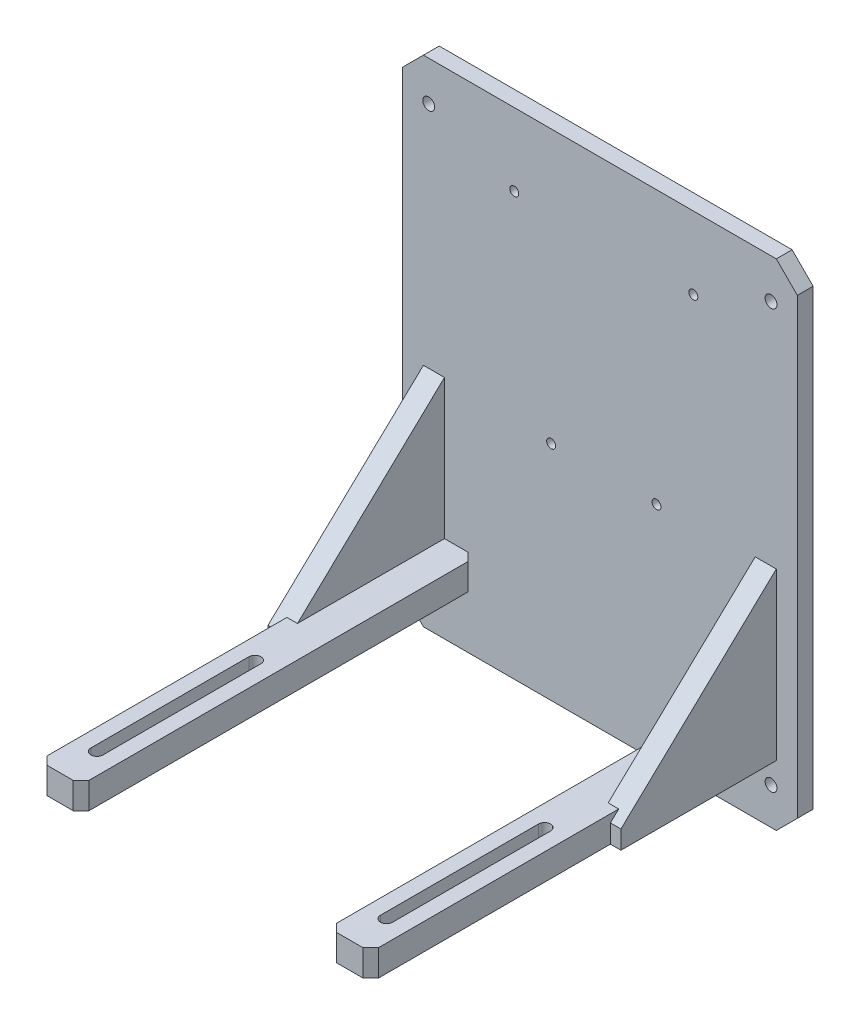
ISO-10303-21;
HEADER;
FILE_DESCRIPTION(('STEP AP214'),'2;1');
FILE_NAME('part.step','',(''),(''),'','','');
FILE_SCHEMA(('AUTOMOTIVE_DESIGN { 1 0 10303 214 1 1 1 1 }'));
ENDSEC;
DATA;
#1=APPLICATION_CONTEXT('core data for automotive mechanical design processes');
#2=APPLICATION_PROTOCOL_DEFINITION('international standard','automotive_design',2000,#1);
#3=PRODUCT_CONTEXT('',#1,'mechanical');
#4=PRODUCT('Part','Part','',(#3));
#5=PRODUCT_RELATED_PRODUCT_CATEGORY('part','',(#4));
#6=PRODUCT_DEFINITION_FORMATION('','',#4);
#7=PRODUCT_DEFINITION_CONTEXT('part definition',#1,'design');
#8=PRODUCT_DEFINITION('design','',#6,#7);
#9=PRODUCT_DEFINITION_SHAPE('','',#8);
#10=(LENGTH_UNIT() NAMED_UNIT(*) SI_UNIT(.MILLI.,.METRE.));
#11=(NAMED_UNIT(*) PLANE_ANGLE_UNIT() SI_UNIT($,.RADIAN.));
#12=(NAMED_UNIT(*) SI_UNIT($,.STERADIAN.) SOLID_ANGLE_UNIT());
#13=UNCERTAINTY_MEASURE_WITH_UNIT(LENGTH_MEASURE(1.E-05),#10,'distance_accuracy_value','');
#14=(GEOMETRIC_REPRESENTATION_CONTEXT(3) GLOBAL_UNCERTAINTY_ASSIGNED_CONTEXT((#13)) GLOBAL_UNIT_ASSIGNED_CONTEXT((#10,
#11,#12)) REPRESENTATION_CONTEXT('',''));
#15=CARTESIAN_POINT('',(0.,0.,0.));
#16=DIRECTION('',(0.,0.,1.));
#17=DIRECTION('',(1.,0.,0.));
#18=AXIS2_PLACEMENT_3D('',#15,#16,#17);
#19=CARTESIAN_POINT('',(0.,0.,6.));
#20=DIRECTION('',(0.,0.,1.));
#21=DIRECTION('',(1.,0.,0.));
#22=AXIS2_PLACEMENT_3D('',#19,#20,#21);
#23=PLANE('',#22);
#24=DIRECTION('',(0.,1.,0.));
#25=VECTOR('',#24,1.);
#26=CARTESIAN_POINT('',(-59.,-105.,6.));
#27=LINE('',#26,#25);
#28=CARTESIAN_POINT('',(-59.,-95.,6.00000000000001));
#29=VERTEX_POINT('',#28);
#30=CARTESIAN_POINT('',(-59.,-42.,6.));
#31=VERTEX_POINT('',#30);
#32=EDGE_CURVE('E325',#29,#31,#27,.T.);
#33=ORIENTED_EDGE('',*,*,#32,.F.);
#34=DIRECTION('',(-1.,0.,0.));
#35=VECTOR('',#34,1.);
#36=CARTESIAN_POINT('',(-60.,-95.,6.00000000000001));
#37=LINE('',#36,#35);
#38=CARTESIAN_POINT('',(-50.,-95.,6.));
#39=VERTEX_POINT('',#38);
#40=EDGE_CURVE('E400',#39,#29,#37,.T.);
#41=ORIENTED_EDGE('',*,*,#40,.F.);
#42=DIRECTION('',(0.,-1.,0.));
#43=VECTOR('',#42,1.);
#44=CARTESIAN_POINT('',(-50.,-95.,6.));
#45=LINE('',#44,#43);
#46=CARTESIAN_POINT('',(-50.,-105.,6.));
#47=VERTEX_POINT('',#46);
#48=EDGE_CURVE('E403',#39,#47,#45,.T.);
#49=ORIENTED_EDGE('',*,*,#48,.T.);
#50=DIRECTION('',(-1.,0.,0.));
#51=VECTOR('',#50,1.);
#52=CARTESIAN_POINT('',(-60.,-105.,6.00000000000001));
#53=LINE('',#52,#51);
#54=CARTESIAN_POINT('',(-67.,-105.,6.));
#55=VERTEX_POINT('',#54);
#56=EDGE_CURVE('E390',#47,#55,#53,.T.);
#57=ORIENTED_EDGE('',*,*,#56,.T.);
#58=DIRECTION('',(0.,1.,0.));
#59=VECTOR('',#58,1.);
#60=CARTESIAN_POINT('',(-67.,-105.,6.));
#61=LINE('',#60,#59);
#62=CARTESIAN_POINT('',(-67.,-42.,6.));
#63=VERTEX_POINT('',#62);
#64=EDGE_CURVE('E335',#55,#63,#61,.T.);
#65=ORIENTED_EDGE('',*,*,#64,.T.);
#66=DIRECTION('',(-1.,0.,0.));
#67=VECTOR('',#66,1.);
#68=CARTESIAN_POINT('',(-59.,-42.,6.));
#69=LINE('',#68,#67);
#70=EDGE_CURVE('E345',#31,#63,#69,.T.);
#71=ORIENTED_EDGE('',*,*,#70,.F.);
#72=EDGE_LOOP('',(#33,#41,#49,#57,#65,#71));
#73=FACE_BOUND('',#72,.T.);
#74=CARTESIAN_POINT('',(-65.,45.,6.));
#75=DIRECTION('',(0.,0.,1.));
#76=DIRECTION('',(1.,0.,0.));
#77=AXIS2_PLACEMENT_3D('',#74,#75,#76);
#78=CIRCLE('',#77,2.25);
#79=CARTESIAN_POINT('',(-62.75,45.,6.));
#80=VERTEX_POINT('',#79);
#81=EDGE_CURVE('E518',#80,#80,#78,.T.);
#82=ORIENTED_EDGE('',*,*,#81,.F.);
#83=EDGE_LOOP('',(#82));
#84=FACE_BOUND('',#83,.T.);
#85=CARTESIAN_POINT('',(-65.,-114.,6.));
#86=DIRECTION('',(0.,0.,1.));
#87=DIRECTION('',(1.,0.,0.));
#88=AXIS2_PLACEMENT_3D('',#85,#86,#87);
#89=CIRCLE('',#88,2.25);
#90=CARTESIAN_POINT('',(-62.75,-114.,6.));
#91=VERTEX_POINT('',#90);
#92=EDGE_CURVE('E530',#91,#91,#89,.T.);
#93=ORIENTED_EDGE('',*,*,#92,.F.);
#94=EDGE_LOOP('',(#93));
#95=FACE_BOUND('',#94,.T.);
#96=CARTESIAN_POINT('',(-18.5,-43.5,6.));
#97=DIRECTION('',(0.,0.,1.));
#98=DIRECTION('',(1.,0.,0.));
#99=AXIS2_PLACEMENT_3D('',#96,#97,#98);
#100=CIRCLE('',#99,1.7);
#101=CARTESIAN_POINT('',(-16.8,-43.5,6.));
#102=VERTEX_POINT('',#101);
#103=EDGE_CURVE('E542',#102,#102,#100,.T.);
#104=ORIENTED_EDGE('',*,*,#103,.F.);
#105=EDGE_LOOP('',(#104));
#106=FACE_BOUND('',#105,.T.);
#107=CARTESIAN_POINT('',(-32.5,32.5,6.));
#108=DIRECTION('',(0.,0.,1.));
#109=DIRECTION('',(1.,0.,0.));
#110=AXIS2_PLACEMENT_3D('',#107,#108,#109);
#111=CIRCLE('',#110,1.7);
#112=CARTESIAN_POINT('',(-30.8,32.5,6.));
#113=VERTEX_POINT('',#112);
#114=EDGE_CURVE('E554',#113,#113,#111,.T.);
#115=ORIENTED_EDGE('',*,*,#114,.F.);
#116=EDGE_LOOP('',(#115));
#117=FACE_BOUND('',#116,.T.);
#118=DIRECTION('',(0.707106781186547,-0.707106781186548,0.));
#119=VECTOR('',#118,1.);
#120=CARTESIAN_POINT('',(-75.,-120.,6.));
#121=LINE('',#120,#119);
#122=CARTESIAN_POINT('',(-75.,-120.,6.));
#123=VERTEX_POINT('',#122);
#124=CARTESIAN_POINT('',(-67.,-128.,6.));
#125=VERTEX_POINT('',#124);
#126=EDGE_CURVE('E560',#123,#125,#121,.T.);
#127=ORIENTED_EDGE('',*,*,#126,.T.);
#128=DIRECTION('',(1.,0.,0.));
#129=VECTOR('',#128,1.);
#130=CARTESIAN_POINT('',(-67.,-128.,6.));
#131=LINE('',#130,#129);
#132=CARTESIAN_POINT('',(67.,-128.,6.));
#133=VERTEX_POINT('',#132);
#134=EDGE_CURVE('E563',#125,#133,#131,.T.);
#135=ORIENTED_EDGE('',*,*,#134,.T.);
#136=DIRECTION('',(0.707106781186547,0.707106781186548,0.));
#137=VECTOR('',#136,1.);
#138=CARTESIAN_POINT('',(67.,-128.,6.));
#139=LINE('',#138,#137);
#140=CARTESIAN_POINT('',(75.,-120.,6.));
#141=VERTEX_POINT('',#140);
#142=EDGE_CURVE('E566',#133,#141,#139,.T.);
#143=ORIENTED_EDGE('',*,*,#142,.T.);
#144=DIRECTION('',(0.,1.,0.));
#145=VECTOR('',#144,1.);
#146=CARTESIAN_POINT('',(75.,-120.,6.));
#147=LINE('',#146,#145);
#148=CARTESIAN_POINT('',(75.,52.,6.));
#149=VERTEX_POINT('',#148);
#150=EDGE_CURVE('E568',#141,#149,#147,.T.);
#151=ORIENTED_EDGE('',*,*,#150,.T.);
#152=DIRECTION('',(-0.707106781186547,0.707106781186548,0.));
#153=VECTOR('',#152,1.);
#154=CARTESIAN_POINT('',(75.,52.,6.));
#155=LINE('',#154,#153);
#156=CARTESIAN_POINT('',(67.,60.,6.));
#157=VERTEX_POINT('',#156);
#158=EDGE_CURVE('E570',#149,#157,#155,.T.);
#159=ORIENTED_EDGE('',*,*,#158,.T.);
#160=DIRECTION('',(-1.,0.,0.));
#161=VECTOR('',#160,1.);
#162=CARTESIAN_POINT('',(67.,60.,6.));
#163=LINE('',#162,#161);
#164=CARTESIAN_POINT('',(-67.,60.,6.));
#165=VERTEX_POINT('',#164);
#166=EDGE_CURVE('E572',#157,#165,#163,.T.);
#167=ORIENTED_EDGE('',*,*,#166,.T.);
#168=DIRECTION('',(-0.707106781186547,-0.707106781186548,0.));
#169=VECTOR('',#168,1.);
#170=CARTESIAN_POINT('',(-67.,60.,6.));
#171=LINE('',#170,#169);
#172=CARTESIAN_POINT('',(-75.,52.,6.));
#173=VERTEX_POINT('',#172);
#174=EDGE_CURVE('E574',#165,#173,#171,.T.);
#175=ORIENTED_EDGE('',*,*,#174,.T.);
#176=DIRECTION('',(0.,-1.,0.));
#177=VECTOR('',#176,1.);
#178=CARTESIAN_POINT('',(-75.,52.,6.));
#179=LINE('',#178,#177);
#180=EDGE_CURVE('E576',#173,#123,#179,.T.);
#181=ORIENTED_EDGE('',*,*,#180,.T.);
#182=EDGE_LOOP('',(#127,#135,#143,#151,#159,#167,#175,#181));
#183=FACE_BOUND('',#182,.T.);
#184=CARTESIAN_POINT('',(35.5,32.5,6.));
#185=DIRECTION('',(0.,0.,1.));
#186=DIRECTION('',(1.,0.,0.));
#187=AXIS2_PLACEMENT_3D('',#184,#185,#186);
#188=CIRCLE('',#187,1.7);
#189=CARTESIAN_POINT('',(37.2,32.5,6.));
#190=VERTEX_POINT('',#189);
#191=EDGE_CURVE('E548',#190,#190,#188,.T.);
#192=ORIENTED_EDGE('',*,*,#191,.F.);
#193=EDGE_LOOP('',(#192));
#194=FACE_BOUND('',#193,.T.);
#195=CARTESIAN_POINT('',(21.5,-43.5,6.));
#196=DIRECTION('',(0.,0.,1.));
#197=DIRECTION('',(1.,0.,0.));
#198=AXIS2_PLACEMENT_3D('',#195,#196,#197);
#199=CIRCLE('',#198,1.7);
#200=CARTESIAN_POINT('',(23.2,-43.5,6.));
#201=VERTEX_POINT('',#200);
#202=EDGE_CURVE('E536',#201,#201,#199,.T.);
#203=ORIENTED_EDGE('',*,*,#202,.F.);
#204=EDGE_LOOP('',(#203));
#205=FACE_BOUND('',#204,.T.);
#206=CARTESIAN_POINT('',(65.,-114.,6.));
#207=DIRECTION('',(0.,0.,1.));
#208=DIRECTION('',(1.,0.,0.));
#209=AXIS2_PLACEMENT_3D('',#206,#207,#208);
#210=CIRCLE('',#209,2.25);
#211=CARTESIAN_POINT('',(67.25,-114.,6.));
#212=VERTEX_POINT('',#211);
#213=EDGE_CURVE('E524',#212,#212,#210,.T.);
#214=ORIENTED_EDGE('',*,*,#213,.F.);
#215=EDGE_LOOP('',(#214));
#216=FACE_BOUND('',#215,.T.);
#217=CARTESIAN_POINT('',(65.,45.,6.));
#218=DIRECTION('',(0.,0.,1.));
#219=DIRECTION('',(1.,0.,0.));
#220=AXIS2_PLACEMENT_3D('',#217,#218,#219);
#221=CIRCLE('',#220,2.25);
#222=CARTESIAN_POINT('',(67.25,45.,6.));
#223=VERTEX_POINT('',#222);
#224=EDGE_CURVE('E512',#223,#223,#221,.T.);
#225=ORIENTED_EDGE('',*,*,#224,.F.);
#226=EDGE_LOOP('',(#225));
#227=FACE_BOUND('',#226,.T.);
#228=DIRECTION('',(0.,1.,0.));
#229=VECTOR('',#228,1.);
#230=CARTESIAN_POINT('',(67.,-105.,6.));
#231=LINE('',#230,#229);
#232=CARTESIAN_POINT('',(67.,-105.,6.));
#233=VERTEX_POINT('',#232);
#234=CARTESIAN_POINT('',(67.,-42.,6.));
#235=VERTEX_POINT('',#234);
#236=EDGE_CURVE('E295',#233,#235,#231,.T.);
#237=ORIENTED_EDGE('',*,*,#236,.F.);
#238=DIRECTION('',(-1.,0.,0.));
#239=VECTOR('',#238,1.);
#240=CARTESIAN_POINT('',(50.,-105.,6.));
#241=LINE('',#240,#239);
#242=CARTESIAN_POINT('',(50.,-105.,6.));
#243=VERTEX_POINT('',#242);
#244=EDGE_CURVE('E58',#233,#243,#241,.T.);
#245=ORIENTED_EDGE('',*,*,#244,.T.);
#246=DIRECTION('',(0.,-1.,0.));
#247=VECTOR('',#246,1.);
#248=CARTESIAN_POINT('',(50.,-95.,6.));
#249=LINE('',#248,#247);
#250=CARTESIAN_POINT('',(50.,-95.,6.));
#251=VERTEX_POINT('',#250);
#252=EDGE_CURVE('E449',#251,#243,#249,.T.);
#253=ORIENTED_EDGE('',*,*,#252,.F.);
#254=DIRECTION('',(-1.,0.,0.));
#255=VECTOR('',#254,1.);
#256=CARTESIAN_POINT('',(50.,-95.,6.));
#257=LINE('',#256,#255);
#258=CARTESIAN_POINT('',(59.,-95.,6.));
#259=VERTEX_POINT('',#258);
#260=EDGE_CURVE('E452',#259,#251,#257,.T.);
#261=ORIENTED_EDGE('',*,*,#260,.F.);
#262=DIRECTION('',(0.,1.,0.));
#263=VECTOR('',#262,1.);
#264=CARTESIAN_POINT('',(59.,-105.,6.));
#265=LINE('',#264,#263);
#266=CARTESIAN_POINT('',(59.,-42.,6.));
#267=VERTEX_POINT('',#266);
#268=EDGE_CURVE('E313',#259,#267,#265,.T.);
#269=ORIENTED_EDGE('',*,*,#268,.T.);
#270=DIRECTION('',(-1.,0.,0.));
#271=VECTOR('',#270,1.);
#272=CARTESIAN_POINT('',(67.,-42.,6.));
#273=LINE('',#272,#271);
#274=EDGE_CURVE('E65',#235,#267,#273,.T.);
#275=ORIENTED_EDGE('',*,*,#274,.F.);
#276=EDGE_LOOP('',(#237,#245,#253,#261,#269,#275));
#277=FACE_BOUND('',#276,.T.);
#278=ADVANCED_FACE('F43',(#73,#84,#95,#106,#117,#183,#194,#205,#216,#227,#277),#23,.T.);
#279=CARTESIAN_POINT('',(0.,-95.,0.));
#280=DIRECTION('',(0.,-1.,0.));
#281=DIRECTION('',(0.,0.,-1.));
#282=AXIS2_PLACEMENT_3D('',#279,#280,#281);
#283=PLANE('',#282);
#284=CARTESIAN_POINT('',(55.,-95.,82.));
#285=DIRECTION('',(0.,1.,0.));
#286=DIRECTION('',(0.,0.,1.));
#287=AXIS2_PLACEMENT_3D('',#284,#285,#286);
#288=CIRCLE('',#287,2.3);
#289=CARTESIAN_POINT('',(57.3,-95.,82.));
#290=VERTEX_POINT('',#289);
#291=CARTESIAN_POINT('',(52.7,-95.,82.));
#292=VERTEX_POINT('',#291);
#293=EDGE_CURVE('E497',#290,#292,#288,.T.);
#294=ORIENTED_EDGE('',*,*,#293,.F.);
#295=DIRECTION('',(0.,0.,-1.));
#296=VECTOR('',#295,1.);
#297=CARTESIAN_POINT('',(57.3,-95.,142.));
#298=LINE('',#297,#296);
#299=CARTESIAN_POINT('',(57.3,-95.,142.));
#300=VERTEX_POINT('',#299);
#301=EDGE_CURVE('E492',#300,#290,#298,.T.);
#302=ORIENTED_EDGE('',*,*,#301,.F.);
#303=CARTESIAN_POINT('',(55.,-95.,142.));
#304=DIRECTION('',(0.,1.,0.));
#305=DIRECTION('',(0.,0.,1.));
#306=AXIS2_PLACEMENT_3D('',#303,#304,#305);
#307=CIRCLE('',#306,2.3);
#308=CARTESIAN_POINT('',(52.7,-95.,142.));
#309=VERTEX_POINT('',#308);
#310=EDGE_CURVE('E506',#309,#300,#307,.T.);
#311=ORIENTED_EDGE('',*,*,#310,.F.);
#312=DIRECTION('',(0.,0.,1.));
#313=VECTOR('',#312,1.);
#314=CARTESIAN_POINT('',(52.7,-95.,82.));
#315=LINE('',#314,#313);
#316=EDGE_CURVE('E509',#292,#309,#315,.T.);
#317=ORIENTED_EDGE('',*,*,#316,.F.);
#318=EDGE_LOOP('',(#294,#302,#311,#317));
#319=FACE_BOUND('',#318,.T.);
#320=DIRECTION('',(1.,0.,0.));
#321=VECTOR('',#320,1.);
#322=CARTESIAN_POINT('',(0.,-95.,61.8392857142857));
#323=LINE('',#322,#321);
#324=CARTESIAN_POINT('',(59.,-95.,61.8392857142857));
#325=VERTEX_POINT('',#324);
#326=CARTESIAN_POINT('',(63.,-95.,61.8392857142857));
#327=VERTEX_POINT('',#326);
#328=EDGE_CURVE('E319',#325,#327,#323,.T.);
#329=ORIENTED_EDGE('',*,*,#328,.F.);
#330=DIRECTION('',(0.,0.,1.));
#331=VECTOR('',#330,1.);
#332=CARTESIAN_POINT('',(59.,-95.,0.));
#333=LINE('',#332,#331);
#334=EDGE_CURVE('E321',#259,#325,#333,.T.);
#335=ORIENTED_EDGE('',*,*,#334,.F.);
#336=ORIENTED_EDGE('',*,*,#260,.T.);
#337=DIRECTION('',(-0.707106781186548,0.,0.707106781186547));
#338=VECTOR('',#337,1.);
#339=CARTESIAN_POINT('',(47.,-95.,9.));
#340=LINE('',#339,#338);
#341=CARTESIAN_POINT('',(47.,-95.,9.));
#342=VERTEX_POINT('',#341);
#343=EDGE_CURVE('E455',#251,#342,#340,.T.);
#344=ORIENTED_EDGE('',*,*,#343,.T.);
#345=DIRECTION('',(0.,0.,1.));
#346=VECTOR('',#345,1.);
#347=CARTESIAN_POINT('',(47.,-95.,153.));
#348=LINE('',#347,#346);
#349=CARTESIAN_POINT('',(47.,-95.,153.));
#350=VERTEX_POINT('',#349);
#351=EDGE_CURVE('E479',#342,#350,#348,.T.);
#352=ORIENTED_EDGE('',*,*,#351,.T.);
#353=DIRECTION('',(0.707106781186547,0.,0.707106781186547));
#354=VECTOR('',#353,1.);
#355=CARTESIAN_POINT('',(50.,-95.,156.));
#356=LINE('',#355,#354);
#357=CARTESIAN_POINT('',(50.,-95.,156.));
#358=VERTEX_POINT('',#357);
#359=EDGE_CURVE('E477',#350,#358,#356,.T.);
#360=ORIENTED_EDGE('',*,*,#359,.T.);
#361=DIRECTION('',(1.,0.,0.));
#362=VECTOR('',#361,1.);
#363=CARTESIAN_POINT('',(60.,-95.,156.));
#364=LINE('',#363,#362);
#365=CARTESIAN_POINT('',(60.,-95.,156.));
#366=VERTEX_POINT('',#365);
#367=EDGE_CURVE('E475',#358,#366,#364,.T.);
#368=ORIENTED_EDGE('',*,*,#367,.T.);
#369=DIRECTION('',(0.707106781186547,0.,-0.707106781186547));
#370=VECTOR('',#369,1.);
#371=CARTESIAN_POINT('',(63.,-95.,153.));
#372=LINE('',#371,#370);
#373=CARTESIAN_POINT('',(63.,-95.,153.));
#374=VERTEX_POINT('',#373);
#375=EDGE_CURVE('E473',#366,#374,#372,.T.);
#376=ORIENTED_EDGE('',*,*,#375,.T.);
#377=DIRECTION('',(0.,0.,-1.));
#378=VECTOR('',#377,1.);
#379=CARTESIAN_POINT('',(63.,-95.,9.));
#380=LINE('',#379,#378);
#381=EDGE_CURVE('E470',#374,#327,#380,.T.);
#382=ORIENTED_EDGE('',*,*,#381,.T.);
#383=EDGE_LOOP('',(#329,#335,#336,#344,#352,#360,#368,#376,#382));
#384=FACE_BOUND('',#383,.T.);
#385=ADVANCED_FACE('F658',(#319,#384),#283,.F.);
#386=CARTESIAN_POINT('',(63.,-95.,9.));
#387=DIRECTION('',(-1.,0.,0.));
#388=DIRECTION('',(0.,0.,1.));
#389=AXIS2_PLACEMENT_3D('',#386,#387,#388);
#390=PLANE('',#389);
#391=DIRECTION('',(0.,-0.688426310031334,0.72530629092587));
#392=VECTOR('',#391,1.);
#393=CARTESIAN_POINT('',(63.,-68.6162913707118,34.0421641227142));
#394=LINE('',#393,#392);
#395=CARTESIAN_POINT('',(63.,-98.,65.));
#396=VERTEX_POINT('',#395);
#397=EDGE_CURVE('E11',#327,#396,#394,.T.);
#398=ORIENTED_EDGE('',*,*,#397,.F.);
#399=ORIENTED_EDGE('',*,*,#381,.F.);
#400=DIRECTION('',(0.,-1.,0.));
#401=VECTOR('',#400,1.);
#402=CARTESIAN_POINT('',(63.,-95.,153.));
#403=LINE('',#402,#401);
#404=CARTESIAN_POINT('',(63.,-105.,153.));
#405=VERTEX_POINT('',#404);
#406=EDGE_CURVE('E446',#374,#405,#403,.T.);
#407=ORIENTED_EDGE('',*,*,#406,.T.);
#408=DIRECTION('',(0.,0.,-1.));
#409=VECTOR('',#408,1.);
#410=CARTESIAN_POINT('',(63.,-105.,9.));
#411=LINE('',#410,#409);
#412=CARTESIAN_POINT('',(63.,-105.,65.));
#413=VERTEX_POINT('',#412);
#414=EDGE_CURVE('E454',#405,#413,#411,.T.);
#415=ORIENTED_EDGE('',*,*,#414,.T.);
#416=DIRECTION('',(0.,-1.,0.));
#417=VECTOR('',#416,1.);
#418=CARTESIAN_POINT('',(63.,-95.,65.));
#419=LINE('',#418,#417);
#420=EDGE_CURVE('E51',#396,#413,#419,.T.);
#421=ORIENTED_EDGE('',*,*,#420,.F.);
#422=EDGE_LOOP('',(#398,#399,#407,#415,#421));
#423=FACE_BOUND('',#422,.T.);
#424=ADVANCED_FACE('F629',(#423),#390,.F.);
#425=CARTESIAN_POINT('',(0.,-95.,0.));
#426=DIRECTION('',(0.,-1.,0.));
#427=DIRECTION('',(0.,0.,-1.));
#428=AXIS2_PLACEMENT_3D('',#425,#426,#427);
#429=PLANE('',#428);
#430=CARTESIAN_POINT('',(-55.,-95.,82.));
#431=DIRECTION('',(0.,1.,0.));
#432=DIRECTION('',(0.,0.,1.));
#433=AXIS2_PLACEMENT_3D('',#430,#431,#432);
#434=CIRCLE('',#433,2.3);
#435=CARTESIAN_POINT('',(-52.7,-95.,82.));
#436=VERTEX_POINT('',#435);
#437=CARTESIAN_POINT('',(-57.3,-95.,82.));
#438=VERTEX_POINT('',#437);
#439=EDGE_CURVE('E354',#436,#438,#434,.T.);
#440=ORIENTED_EDGE('',*,*,#439,.F.);
#441=DIRECTION('',(0.,0.,-1.));
#442=VECTOR('',#441,1.);
#443=CARTESIAN_POINT('',(-52.7,-95.,142.));
#444=LINE('',#443,#442);
#445=CARTESIAN_POINT('',(-52.7,-95.,142.));
#446=VERTEX_POINT('',#445);
#447=EDGE_CURVE('E362',#446,#436,#444,.T.);
#448=ORIENTED_EDGE('',*,*,#447,.F.);
#449=CARTESIAN_POINT('',(-55.,-95.,142.));
#450=DIRECTION('',(0.,1.,0.));
#451=DIRECTION('',(0.,0.,1.));
#452=AXIS2_PLACEMENT_3D('',#449,#450,#451);
#453=CIRCLE('',#452,2.3);
#454=CARTESIAN_POINT('',(-57.3,-95.,142.));
#455=VERTEX_POINT('',#454);
#456=EDGE_CURVE('E359',#455,#446,#453,.T.);
#457=ORIENTED_EDGE('',*,*,#456,.F.);
#458=DIRECTION('',(0.,0.,1.));
#459=VECTOR('',#458,1.);
#460=CARTESIAN_POINT('',(-57.3,-95.,82.));
#461=LINE('',#460,#459);
#462=EDGE_CURVE('E356',#438,#455,#461,.T.);
#463=ORIENTED_EDGE('',*,*,#462,.F.);
#464=EDGE_LOOP('',(#440,#448,#457,#463));
#465=FACE_BOUND('',#464,.T.);
#466=DIRECTION('',(1.,0.,0.));
#467=VECTOR('',#466,1.);
#468=CARTESIAN_POINT('',(0.,-95.,61.8392857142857));
#469=LINE('',#468,#467);
#470=CARTESIAN_POINT('',(-63.,-95.,61.8392857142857));
#471=VERTEX_POINT('',#470);
#472=CARTESIAN_POINT('',(-59.,-95.,61.8392857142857));
#473=VERTEX_POINT('',#472);
#474=EDGE_CURVE('E348',#471,#473,#469,.T.);
#475=ORIENTED_EDGE('',*,*,#474,.F.);
#476=DIRECTION('',(0.,0.,1.));
#477=VECTOR('',#476,1.);
#478=CARTESIAN_POINT('',(-63.,-95.,153.));
#479=LINE('',#478,#477);
#480=CARTESIAN_POINT('',(-63.,-95.,153.));
#481=VERTEX_POINT('',#480);
#482=EDGE_CURVE('E387',#471,#481,#479,.T.);
#483=ORIENTED_EDGE('',*,*,#482,.T.);
#484=DIRECTION('',(0.707106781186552,0.,0.707106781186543));
#485=VECTOR('',#484,1.);
#486=CARTESIAN_POINT('',(-60.,-95.,156.));
#487=LINE('',#486,#485);
#488=CARTESIAN_POINT('',(-60.,-95.,156.));
#489=VERTEX_POINT('',#488);
#490=EDGE_CURVE('E389',#481,#489,#487,.T.);
#491=ORIENTED_EDGE('',*,*,#490,.T.);
#492=DIRECTION('',(1.,0.,0.));
#493=VECTOR('',#492,1.);
#494=CARTESIAN_POINT('',(-50.,-95.,156.));
#495=LINE('',#494,#493);
#496=CARTESIAN_POINT('',(-50.,-95.,156.));
#497=VERTEX_POINT('',#496);
#498=EDGE_CURVE('E392',#489,#497,#495,.T.);
#499=ORIENTED_EDGE('',*,*,#498,.T.);
#500=DIRECTION('',(0.707106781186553,0.,-0.707106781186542));
#501=VECTOR('',#500,1.);
#502=CARTESIAN_POINT('',(-47.,-95.,153.));
#503=LINE('',#502,#501);
#504=CARTESIAN_POINT('',(-47.,-95.,153.));
#505=VERTEX_POINT('',#504);
#506=EDGE_CURVE('E394',#497,#505,#503,.T.);
#507=ORIENTED_EDGE('',*,*,#506,.T.);
#508=DIRECTION('',(0.,0.,-1.));
#509=VECTOR('',#508,1.);
#510=CARTESIAN_POINT('',(-47.,-95.,9.));
#511=LINE('',#510,#509);
#512=CARTESIAN_POINT('',(-47.,-95.,9.));
#513=VERTEX_POINT('',#512);
#514=EDGE_CURVE('E396',#505,#513,#511,.T.);
#515=ORIENTED_EDGE('',*,*,#514,.T.);
#516=DIRECTION('',(-0.707106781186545,0.,-0.70710678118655));
#517=VECTOR('',#516,1.);
#518=CARTESIAN_POINT('',(-50.,-95.,6.));
#519=LINE('',#518,#517);
#520=EDGE_CURVE('E398',#513,#39,#519,.T.);
#521=ORIENTED_EDGE('',*,*,#520,.T.);
#522=ORIENTED_EDGE('',*,*,#40,.T.);
#523=DIRECTION('',(0.,0.,1.));
#524=VECTOR('',#523,1.);
#525=CARTESIAN_POINT('',(-59.,-95.,0.));
#526=LINE('',#525,#524);
#527=EDGE_CURVE('E351',#29,#473,#526,.T.);
#528=ORIENTED_EDGE('',*,*,#527,.T.);
#529=EDGE_LOOP('',(#475,#483,#491,#499,#507,#515,#521,#522,#528));
#530=FACE_BOUND('',#529,.T.);
#531=ADVANCED_FACE('F666',(#465,#530),#429,.F.);
#532=CARTESIAN_POINT('',(-63.,-95.,153.));
#533=DIRECTION('',(1.,0.,0.));
#534=DIRECTION('',(0.,0.,-1.));
#535=AXIS2_PLACEMENT_3D('',#532,#533,#534);
#536=PLANE('',#535);
#537=DIRECTION('',(0.,0.688426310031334,-0.72530629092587));
#538=VECTOR('',#537,1.);
#539=CARTESIAN_POINT('',(-63.,-140.518361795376,109.796131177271));
#540=LINE('',#539,#538);
#541=CARTESIAN_POINT('',(-63.,-98.,65.));
#542=VERTEX_POINT('',#541);
#543=EDGE_CURVE('E620',#542,#471,#540,.T.);
#544=ORIENTED_EDGE('',*,*,#543,.F.);
#545=DIRECTION('',(0.,1.,0.));
#546=VECTOR('',#545,1.);
#547=CARTESIAN_POINT('',(-63.,-95.,65.));
#548=LINE('',#547,#546);
#549=CARTESIAN_POINT('',(-63.,-105.,65.));
#550=VERTEX_POINT('',#549);
#551=EDGE_CURVE('E617',#550,#542,#548,.T.);
#552=ORIENTED_EDGE('',*,*,#551,.F.);
#553=DIRECTION('',(0.,0.,1.));
#554=VECTOR('',#553,1.);
#555=CARTESIAN_POINT('',(-63.,-105.,153.));
#556=LINE('',#555,#554);
#557=CARTESIAN_POINT('',(-63.,-105.,153.));
#558=VERTEX_POINT('',#557);
#559=EDGE_CURVE('E386',#550,#558,#556,.T.);
#560=ORIENTED_EDGE('',*,*,#559,.T.);
#561=DIRECTION('',(0.,-1.,0.));
#562=VECTOR('',#561,1.);
#563=CARTESIAN_POINT('',(-63.,-95.,153.));
#564=LINE('',#563,#562);
#565=EDGE_CURVE('E431',#481,#558,#564,.T.);
#566=ORIENTED_EDGE('',*,*,#565,.F.);
#567=ORIENTED_EDGE('',*,*,#482,.F.);
#568=EDGE_LOOP('',(#544,#552,#560,#566,#567));
#569=FACE_BOUND('',#568,.T.);
#570=ADVANCED_FACE('F726',(#569),#536,.F.);
#571=CARTESIAN_POINT('',(0.,0.,0.));
#572=DIRECTION('',(0.,0.,1.));
#573=DIRECTION('',(1.,0.,0.));
#574=AXIS2_PLACEMENT_3D('',#571,#572,#573);
#575=PLANE('',#574);
#576=DIRECTION('',(0.707106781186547,-0.707106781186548,0.));
#577=VECTOR('',#576,1.);
#578=CARTESIAN_POINT('',(-75.,-120.,0.));
#579=LINE('',#578,#577);
#580=CARTESIAN_POINT('',(-75.,-120.,0.));
#581=VERTEX_POINT('',#580);
#582=CARTESIAN_POINT('',(-67.,-128.,0.));
#583=VERTEX_POINT('',#582);
#584=EDGE_CURVE('E557',#581,#583,#579,.T.);
#585=ORIENTED_EDGE('',*,*,#584,.F.);
#586=DIRECTION('',(0.,-1.,0.));
#587=VECTOR('',#586,1.);
#588=CARTESIAN_POINT('',(-75.,52.,0.));
#589=LINE('',#588,#587);
#590=CARTESIAN_POINT('',(-75.,52.,0.));
#591=VERTEX_POINT('',#590);
#592=EDGE_CURVE('E564',#591,#581,#589,.T.);
#593=ORIENTED_EDGE('',*,*,#592,.F.);
#594=DIRECTION('',(-0.707106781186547,-0.707106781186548,0.));
#595=VECTOR('',#594,1.);
#596=CARTESIAN_POINT('',(-67.,60.,0.));
#597=LINE('',#596,#595);
#598=CARTESIAN_POINT('',(-67.,60.,0.));
#599=VERTEX_POINT('',#598);
#600=EDGE_CURVE('E591',#599,#591,#597,.T.);
#601=ORIENTED_EDGE('',*,*,#600,.F.);
#602=DIRECTION('',(-1.,0.,0.));
#603=VECTOR('',#602,1.);
#604=CARTESIAN_POINT('',(67.,60.,0.));
#605=LINE('',#604,#603);
#606=CARTESIAN_POINT('',(67.,60.,0.));
#607=VERTEX_POINT('',#606);
#608=EDGE_CURVE('E589',#607,#599,#605,.T.);
#609=ORIENTED_EDGE('',*,*,#608,.F.);
#610=DIRECTION('',(-0.707106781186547,0.707106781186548,0.));
#611=VECTOR('',#610,1.);
#612=CARTESIAN_POINT('',(75.,52.,0.));
#613=LINE('',#612,#611);
#614=CARTESIAN_POINT('',(75.,52.,0.));
#615=VERTEX_POINT('',#614);
#616=EDGE_CURVE('E587',#615,#607,#613,.T.);
#617=ORIENTED_EDGE('',*,*,#616,.F.);
#618=DIRECTION('',(0.,1.,0.));
#619=VECTOR('',#618,1.);
#620=CARTESIAN_POINT('',(75.,-120.,0.));
#621=LINE('',#620,#619);
#622=CARTESIAN_POINT('',(75.,-120.,0.));
#623=VERTEX_POINT('',#622);
#624=EDGE_CURVE('E585',#623,#615,#621,.T.);
#625=ORIENTED_EDGE('',*,*,#624,.F.);
#626=DIRECTION('',(0.707106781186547,0.707106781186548,0.));
#627=VECTOR('',#626,1.);
#628=CARTESIAN_POINT('',(67.,-128.,0.));
#629=LINE('',#628,#627);
#630=CARTESIAN_POINT('',(67.,-128.,0.));
#631=VERTEX_POINT('',#630);
#632=EDGE_CURVE('E583',#631,#623,#629,.T.);
#633=ORIENTED_EDGE('',*,*,#632,.F.);
#634=DIRECTION('',(1.,0.,0.));
#635=VECTOR('',#634,1.);
#636=CARTESIAN_POINT('',(-67.,-128.,0.));
#637=LINE('',#636,#635);
#638=EDGE_CURVE('E581',#583,#631,#637,.T.);
#639=ORIENTED_EDGE('',*,*,#638,.F.);
#640=EDGE_LOOP('',(#585,#593,#601,#609,#617,#625,#633,#639));
#641=FACE_BOUND('',#640,.T.);
#642=CARTESIAN_POINT('',(-32.5,32.5,0.));
#643=DIRECTION('',(0.,0.,1.));
#644=DIRECTION('',(1.,0.,0.));
#645=AXIS2_PLACEMENT_3D('',#642,#643,#644);
#646=CIRCLE('',#645,1.7);
#647=CARTESIAN_POINT('',(-30.8,32.5,0.));
#648=VERTEX_POINT('',#647);
#649=EDGE_CURVE('E551',#648,#648,#646,.T.);
#650=ORIENTED_EDGE('',*,*,#649,.T.);
#651=EDGE_LOOP('',(#650));
#652=FACE_BOUND('',#651,.T.);
#653=CARTESIAN_POINT('',(35.5,32.5,0.));
#654=DIRECTION('',(0.,0.,1.));
#655=DIRECTION('',(1.,0.,0.));
#656=AXIS2_PLACEMENT_3D('',#653,#654,#655);
#657=CIRCLE('',#656,1.7);
#658=CARTESIAN_POINT('',(37.2,32.5,0.));
#659=VERTEX_POINT('',#658);
#660=EDGE_CURVE('E545',#659,#659,#657,.T.);
#661=ORIENTED_EDGE('',*,*,#660,.T.);
#662=EDGE_LOOP('',(#661));
#663=FACE_BOUND('',#662,.T.);
#664=CARTESIAN_POINT('',(-18.5,-43.5,0.));
#665=DIRECTION('',(0.,0.,1.));
#666=DIRECTION('',(1.,0.,0.));
#667=AXIS2_PLACEMENT_3D('',#664,#665,#666);
#668=CIRCLE('',#667,1.7);
#669=CARTESIAN_POINT('',(-16.8,-43.5,0.));
#670=VERTEX_POINT('',#669);
#671=EDGE_CURVE('E539',#670,#670,#668,.T.);
#672=ORIENTED_EDGE('',*,*,#671,.T.);
#673=EDGE_LOOP('',(#672));
#674=FACE_BOUND('',#673,.T.);
#675=CARTESIAN_POINT('',(21.5,-43.5,0.));
#676=DIRECTION('',(0.,0.,1.));
#677=DIRECTION('',(1.,0.,0.));
#678=AXIS2_PLACEMENT_3D('',#675,#676,#677);
#679=CIRCLE('',#678,1.7);
#680=CARTESIAN_POINT('',(23.2,-43.5,0.));
#681=VERTEX_POINT('',#680);
#682=EDGE_CURVE('E533',#681,#681,#679,.T.);
#683=ORIENTED_EDGE('',*,*,#682,.T.);
#684=EDGE_LOOP('',(#683));
#685=FACE_BOUND('',#684,.T.);
#686=CARTESIAN_POINT('',(-65.,-114.,0.));
#687=DIRECTION('',(0.,0.,1.));
#688=DIRECTION('',(1.,0.,0.));
#689=AXIS2_PLACEMENT_3D('',#686,#687,#688);
#690=CIRCLE('',#689,2.25);
#691=CARTESIAN_POINT('',(-62.75,-114.,0.));
#692=VERTEX_POINT('',#691);
#693=EDGE_CURVE('E527',#692,#692,#690,.T.);
#694=ORIENTED_EDGE('',*,*,#693,.T.);
#695=EDGE_LOOP('',(#694));
#696=FACE_BOUND('',#695,.T.);
#697=CARTESIAN_POINT('',(65.,-114.,0.));
#698=DIRECTION('',(0.,0.,1.));
#699=DIRECTION('',(1.,0.,0.));
#700=AXIS2_PLACEMENT_3D('',#697,#698,#699);
#701=CIRCLE('',#700,2.25);
#702=CARTESIAN_POINT('',(67.25,-114.,0.));
#703=VERTEX_POINT('',#702);
#704=EDGE_CURVE('E521',#703,#703,#701,.T.);
#705=ORIENTED_EDGE('',*,*,#704,.T.);
#706=EDGE_LOOP('',(#705));
#707=FACE_BOUND('',#706,.T.);
#708=CARTESIAN_POINT('',(-65.,45.,0.));
#709=DIRECTION('',(0.,0.,1.));
#710=DIRECTION('',(1.,0.,0.));
#711=AXIS2_PLACEMENT_3D('',#708,#709,#710);
#712=CIRCLE('',#711,2.25);
#713=CARTESIAN_POINT('',(-62.75,45.,0.));
#714=VERTEX_POINT('',#713);
#715=EDGE_CURVE('E515',#714,#714,#712,.T.);
#716=ORIENTED_EDGE('',*,*,#715,.T.);
#717=EDGE_LOOP('',(#716));
#718=FACE_BOUND('',#717,.T.);
#719=CARTESIAN_POINT('',(65.,45.,0.));
#720=DIRECTION('',(0.,0.,1.));
#721=DIRECTION('',(1.,0.,0.));
#722=AXIS2_PLACEMENT_3D('',#719,#720,#721);
#723=CIRCLE('',#722,2.25);
#724=CARTESIAN_POINT('',(67.25,45.,0.));
#725=VERTEX_POINT('',#724);
#726=EDGE_CURVE('E434',#725,#725,#723,.T.);
#727=ORIENTED_EDGE('',*,*,#726,.T.);
#728=EDGE_LOOP('',(#727));
#729=FACE_BOUND('',#728,.T.);
#730=ADVANCED_FACE('F723',(#641,#652,#663,#674,#685,#696,#707,#718,#729),#575,.F.);
#731=CARTESIAN_POINT('',(-75.,-120.,6.));
#732=DIRECTION('',(0.707106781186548,0.707106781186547,0.));
#733=DIRECTION('',(-0.707106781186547,0.707106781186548,0.));
#734=AXIS2_PLACEMENT_3D('',#731,#732,#733);
#735=PLANE('',#734);
#736=ORIENTED_EDGE('',*,*,#584,.T.);
#737=DIRECTION('',(0.,0.,-1.));
#738=VECTOR('',#737,1.);
#739=CARTESIAN_POINT('',(-67.,-128.,6.));
#740=LINE('',#739,#738);
#741=EDGE_CURVE('E614',#125,#583,#740,.T.);
#742=ORIENTED_EDGE('',*,*,#741,.F.);
#743=ORIENTED_EDGE('',*,*,#126,.F.);
#744=DIRECTION('',(0.,0.,-1.));
#745=VECTOR('',#744,1.);
#746=CARTESIAN_POINT('',(-75.,-120.,6.));
#747=LINE('',#746,#745);
#748=EDGE_CURVE('E578',#123,#581,#747,.T.);
#749=ORIENTED_EDGE('',*,*,#748,.T.);
#750=EDGE_LOOP('',(#736,#742,#743,#749));
#751=FACE_BOUND('',#750,.T.);
#752=ADVANCED_FACE('F45',(#751),#735,.F.);
#753=CARTESIAN_POINT('',(-67.,-128.,6.));
#754=DIRECTION('',(0.,1.,0.));
#755=DIRECTION('',(0.,0.,1.));
#756=AXIS2_PLACEMENT_3D('',#753,#754,#755);
#757=PLANE('',#756);
#758=ORIENTED_EDGE('',*,*,#638,.T.);
#759=DIRECTION('',(0.,0.,-1.));
#760=VECTOR('',#759,1.);
#761=CARTESIAN_POINT('',(67.,-128.,6.));
#762=LINE('',#761,#760);
#763=EDGE_CURVE('E611',#133,#631,#762,.T.);
#764=ORIENTED_EDGE('',*,*,#763,.F.);
#765=ORIENTED_EDGE('',*,*,#134,.F.);
#766=ORIENTED_EDGE('',*,*,#741,.T.);
#767=EDGE_LOOP('',(#758,#764,#765,#766));
#768=FACE_BOUND('',#767,.T.);
#769=ADVANCED_FACE('F749',(#768),#757,.F.);
#770=CARTESIAN_POINT('',(67.,-128.,6.));
#771=DIRECTION('',(-0.707106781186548,0.707106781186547,0.));
#772=DIRECTION('',(-0.707106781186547,-0.707106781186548,0.));
#773=AXIS2_PLACEMENT_3D('',#770,#771,#772);
#774=PLANE('',#773);
#775=ORIENTED_EDGE('',*,*,#632,.T.);
#776=DIRECTION('',(0.,0.,-1.));
#777=VECTOR('',#776,1.);
#778=CARTESIAN_POINT('',(75.,-120.,6.));
#779=LINE('',#778,#777);
#780=EDGE_CURVE('E608',#141,#623,#779,.T.);
#781=ORIENTED_EDGE('',*,*,#780,.F.);
#782=ORIENTED_EDGE('',*,*,#142,.F.);
#783=ORIENTED_EDGE('',*,*,#763,.T.);
#784=EDGE_LOOP('',(#775,#781,#782,#783));
#785=FACE_BOUND('',#784,.T.);
#786=ADVANCED_FACE('F746',(#785),#774,.F.);
#787=CARTESIAN_POINT('',(75.,-120.,6.));
#788=DIRECTION('',(-1.,0.,0.));
#789=DIRECTION('',(0.,0.,1.));
#790=AXIS2_PLACEMENT_3D('',#787,#788,#789);
#791=PLANE('',#790);
#792=ORIENTED_EDGE('',*,*,#624,.T.);
#793=DIRECTION('',(0.,0.,-1.));
#794=VECTOR('',#793,1.);
#795=CARTESIAN_POINT('',(75.,52.,6.));
#796=LINE('',#795,#794);
#797=EDGE_CURVE('E605',#149,#615,#796,.T.);
#798=ORIENTED_EDGE('',*,*,#797,.F.);
#799=ORIENTED_EDGE('',*,*,#150,.F.);
#800=ORIENTED_EDGE('',*,*,#780,.T.);
#801=EDGE_LOOP('',(#792,#798,#799,#800));
#802=FACE_BOUND('',#801,.T.);
#803=ADVANCED_FACE('F742',(#802),#791,.F.);
#804=CARTESIAN_POINT('',(75.,52.,6.));
#805=DIRECTION('',(-0.707106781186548,-0.707106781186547,0.));
#806=DIRECTION('',(0.707106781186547,-0.707106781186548,0.));
#807=AXIS2_PLACEMENT_3D('',#804,#805,#806);
#808=PLANE('',#807);
#809=ORIENTED_EDGE('',*,*,#616,.T.);
#810=DIRECTION('',(0.,0.,-1.));
#811=VECTOR('',#810,1.);
#812=CARTESIAN_POINT('',(67.,60.,6.));
#813=LINE('',#812,#811);
#814=EDGE_CURVE('E602',#157,#607,#813,.T.);
#815=ORIENTED_EDGE('',*,*,#814,.F.);
#816=ORIENTED_EDGE('',*,*,#158,.F.);
#817=ORIENTED_EDGE('',*,*,#797,.T.);
#818=EDGE_LOOP('',(#809,#815,#816,#817));
#819=FACE_BOUND('',#818,.T.);
#820=ADVANCED_FACE('F738',(#819),#808,.F.);
#821=CARTESIAN_POINT('',(67.,60.,6.));
#822=DIRECTION('',(0.,-1.,0.));
#823=DIRECTION('',(0.,0.,-1.));
#824=AXIS2_PLACEMENT_3D('',#821,#822,#823);
#825=PLANE('',#824);
#826=ORIENTED_EDGE('',*,*,#608,.T.);
#827=DIRECTION('',(0.,0.,-1.));
#828=VECTOR('',#827,1.);
#829=CARTESIAN_POINT('',(-67.,60.,6.));
#830=LINE('',#829,#828);
#831=EDGE_CURVE('E599',#165,#599,#830,.T.);
#832=ORIENTED_EDGE('',*,*,#831,.F.);
#833=ORIENTED_EDGE('',*,*,#166,.F.);
#834=ORIENTED_EDGE('',*,*,#814,.T.);
#835=EDGE_LOOP('',(#826,#832,#833,#834));
#836=FACE_BOUND('',#835,.T.);
#837=ADVANCED_FACE('F734',(#836),#825,.F.);
#838=CARTESIAN_POINT('',(-67.,60.,6.));
#839=DIRECTION('',(0.707106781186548,-0.707106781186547,0.));
#840=DIRECTION('',(0.707106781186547,0.707106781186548,0.));
#841=AXIS2_PLACEMENT_3D('',#838,#839,#840);
#842=PLANE('',#841);
#843=ORIENTED_EDGE('',*,*,#600,.T.);
#844=DIRECTION('',(0.,0.,-1.));
#845=VECTOR('',#844,1.);
#846=CARTESIAN_POINT('',(-75.,52.,6.));
#847=LINE('',#846,#845);
#848=EDGE_CURVE('E596',#173,#591,#847,.T.);
#849=ORIENTED_EDGE('',*,*,#848,.F.);
#850=ORIENTED_EDGE('',*,*,#174,.F.);
#851=ORIENTED_EDGE('',*,*,#831,.T.);
#852=EDGE_LOOP('',(#843,#849,#850,#851));
#853=FACE_BOUND('',#852,.T.);
#854=ADVANCED_FACE('F730',(#853),#842,.F.);
#855=CARTESIAN_POINT('',(-75.,52.,6.));
#856=DIRECTION('',(1.,0.,0.));
#857=DIRECTION('',(0.,0.,-1.));
#858=AXIS2_PLACEMENT_3D('',#855,#856,#857);
#859=PLANE('',#858);
#860=ORIENTED_EDGE('',*,*,#592,.T.);
#861=ORIENTED_EDGE('',*,*,#748,.F.);
#862=ORIENTED_EDGE('',*,*,#180,.F.);
#863=ORIENTED_EDGE('',*,*,#848,.T.);
#864=EDGE_LOOP('',(#860,#861,#862,#863));
#865=FACE_BOUND('',#864,.T.);
#866=ADVANCED_FACE('F720',(#865),#859,.F.);
#867=CARTESIAN_POINT('',(-32.5,32.5,6.));
#868=DIRECTION('',(0.,0.,-1.));
#869=DIRECTION('',(-1.,0.,0.));
#870=AXIS2_PLACEMENT_3D('',#867,#868,#869);
#871=CYLINDRICAL_SURFACE('',#870,1.7);
#872=ORIENTED_EDGE('',*,*,#114,.T.);
#873=EDGE_LOOP('',(#872));
#874=FACE_BOUND('',#873,.T.);
#875=ORIENTED_EDGE('',*,*,#649,.F.);
#876=EDGE_LOOP('',(#875));
#877=FACE_BOUND('',#876,.T.);
#878=ADVANCED_FACE('F717',(#874,#877),#871,.F.);
#879=CARTESIAN_POINT('',(35.5,32.5,6.));
#880=DIRECTION('',(0.,0.,-1.));
#881=DIRECTION('',(-1.,0.,0.));
#882=AXIS2_PLACEMENT_3D('',#879,#880,#881);
#883=CYLINDRICAL_SURFACE('',#882,1.7);
#884=ORIENTED_EDGE('',*,*,#191,.T.);
#885=EDGE_LOOP('',(#884));
#886=FACE_BOUND('',#885,.T.);
#887=ORIENTED_EDGE('',*,*,#660,.F.);
#888=EDGE_LOOP('',(#887));
#889=FACE_BOUND('',#888,.T.);
#890=ADVANCED_FACE('F713',(#886,#889),#883,.F.);
#891=CARTESIAN_POINT('',(-18.5,-43.5,6.));
#892=DIRECTION('',(0.,0.,-1.));
#893=DIRECTION('',(-1.,0.,0.));
#894=AXIS2_PLACEMENT_3D('',#891,#892,#893);
#895=CYLINDRICAL_SURFACE('',#894,1.7);
#896=ORIENTED_EDGE('',*,*,#103,.T.);
#897=EDGE_LOOP('',(#896));
#898=FACE_BOUND('',#897,.T.);
#899=ORIENTED_EDGE('',*,*,#671,.F.);
#900=EDGE_LOOP('',(#899));
#901=FACE_BOUND('',#900,.T.);
#902=ADVANCED_FACE('F709',(#898,#901),#895,.F.);
#903=CARTESIAN_POINT('',(21.5,-43.5,6.));
#904=DIRECTION('',(0.,0.,-1.));
#905=DIRECTION('',(-1.,0.,0.));
#906=AXIS2_PLACEMENT_3D('',#903,#904,#905);
#907=CYLINDRICAL_SURFACE('',#906,1.7);
#908=ORIENTED_EDGE('',*,*,#202,.T.);
#909=EDGE_LOOP('',(#908));
#910=FACE_BOUND('',#909,.T.);
#911=ORIENTED_EDGE('',*,*,#682,.F.);
#912=EDGE_LOOP('',(#911));
#913=FACE_BOUND('',#912,.T.);
#914=ADVANCED_FACE('F705',(#910,#913),#907,.F.);
#915=CARTESIAN_POINT('',(-65.,-114.,6.));
#916=DIRECTION('',(0.,0.,-1.));
#917=DIRECTION('',(-1.,0.,0.));
#918=AXIS2_PLACEMENT_3D('',#915,#916,#917);
#919=CYLINDRICAL_SURFACE('',#918,2.25);
#920=ORIENTED_EDGE('',*,*,#92,.T.);
#921=EDGE_LOOP('',(#920));
#922=FACE_BOUND('',#921,.T.);
#923=ORIENTED_EDGE('',*,*,#693,.F.);
#924=EDGE_LOOP('',(#923));
#925=FACE_BOUND('',#924,.T.);
#926=ADVANCED_FACE('F701',(#922,#925),#919,.F.);
#927=CARTESIAN_POINT('',(65.,-114.,6.));
#928=DIRECTION('',(0.,0.,-1.));
#929=DIRECTION('',(-1.,0.,0.));
#930=AXIS2_PLACEMENT_3D('',#927,#928,#929);
#931=CYLINDRICAL_SURFACE('',#930,2.25);
#932=ORIENTED_EDGE('',*,*,#213,.T.);
#933=EDGE_LOOP('',(#932));
#934=FACE_BOUND('',#933,.T.);
#935=ORIENTED_EDGE('',*,*,#704,.F.);
#936=EDGE_LOOP('',(#935));
#937=FACE_BOUND('',#936,.T.);
#938=ADVANCED_FACE('F697',(#934,#937),#931,.F.);
#939=CARTESIAN_POINT('',(-65.,45.,6.));
#940=DIRECTION('',(0.,0.,-1.));
#941=DIRECTION('',(-1.,0.,0.));
#942=AXIS2_PLACEMENT_3D('',#939,#940,#941);
#943=CYLINDRICAL_SURFACE('',#942,2.25);
#944=ORIENTED_EDGE('',*,*,#81,.T.);
#945=EDGE_LOOP('',(#944));
#946=FACE_BOUND('',#945,.T.);
#947=ORIENTED_EDGE('',*,*,#715,.F.);
#948=EDGE_LOOP('',(#947));
#949=FACE_BOUND('',#948,.T.);
#950=ADVANCED_FACE('F693',(#946,#949),#943,.F.);
#951=CARTESIAN_POINT('',(65.,45.,6.));
#952=DIRECTION('',(0.,0.,-1.));
#953=DIRECTION('',(-1.,0.,0.));
#954=AXIS2_PLACEMENT_3D('',#951,#952,#953);
#955=CYLINDRICAL_SURFACE('',#954,2.25);
#956=ORIENTED_EDGE('',*,*,#224,.T.);
#957=EDGE_LOOP('',(#956));
#958=FACE_BOUND('',#957,.T.);
#959=ORIENTED_EDGE('',*,*,#726,.F.);
#960=EDGE_LOOP('',(#959));
#961=FACE_BOUND('',#960,.T.);
#962=ADVANCED_FACE('F690',(#958,#961),#955,.F.);
#963=CARTESIAN_POINT('',(0.,-105.,0.));
#964=DIRECTION('',(0.,-1.,0.));
#965=DIRECTION('',(0.,0.,-1.));
#966=AXIS2_PLACEMENT_3D('',#963,#964,#965);
#967=PLANE('',#966);
#968=DIRECTION('',(-1.,0.,0.));
#969=VECTOR('',#968,1.);
#970=CARTESIAN_POINT('',(67.,-105.,65.));
#971=LINE('',#970,#969);
#972=CARTESIAN_POINT('',(67.,-105.,65.));
#973=VERTEX_POINT('',#972);
#974=EDGE_CURVE('E305',#973,#413,#971,.T.);
#975=ORIENTED_EDGE('',*,*,#974,.T.);
#976=ORIENTED_EDGE('',*,*,#414,.F.);
#977=DIRECTION('',(0.707106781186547,0.,-0.707106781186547));
#978=VECTOR('',#977,1.);
#979=CARTESIAN_POINT('',(63.,-105.,153.));
#980=LINE('',#979,#978);
#981=CARTESIAN_POINT('',(60.,-105.,156.));
#982=VERTEX_POINT('',#981);
#983=EDGE_CURVE('E457',#982,#405,#980,.T.);
#984=ORIENTED_EDGE('',*,*,#983,.F.);
#985=DIRECTION('',(1.,0.,0.));
#986=VECTOR('',#985,1.);
#987=CARTESIAN_POINT('',(60.,-105.,156.));
#988=LINE('',#987,#986);
#989=CARTESIAN_POINT('',(50.,-105.,156.));
#990=VERTEX_POINT('',#989);
#991=EDGE_CURVE('E459',#990,#982,#988,.T.);
#992=ORIENTED_EDGE('',*,*,#991,.F.);
#993=DIRECTION('',(0.707106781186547,0.,0.707106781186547));
#994=VECTOR('',#993,1.);
#995=CARTESIAN_POINT('',(50.,-105.,156.));
#996=LINE('',#995,#994);
#997=CARTESIAN_POINT('',(47.,-105.,153.));
#998=VERTEX_POINT('',#997);
#999=EDGE_CURVE('E461',#998,#990,#996,.T.);
#1000=ORIENTED_EDGE('',*,*,#999,.F.);
#1001=DIRECTION('',(0.,0.,1.));
#1002=VECTOR('',#1001,1.);
#1003=CARTESIAN_POINT('',(47.,-105.,153.));
#1004=LINE('',#1003,#1002);
#1005=CARTESIAN_POINT('',(47.,-105.,9.));
#1006=VERTEX_POINT('',#1005);
#1007=EDGE_CURVE('E463',#1006,#998,#1004,.T.);
#1008=ORIENTED_EDGE('',*,*,#1007,.F.);
#1009=DIRECTION('',(-0.707106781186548,0.,0.707106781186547));
#1010=VECTOR('',#1009,1.);
#1011=CARTESIAN_POINT('',(47.,-105.,9.));
#1012=LINE('',#1011,#1010);
#1013=EDGE_CURVE('E465',#243,#1006,#1012,.T.);
#1014=ORIENTED_EDGE('',*,*,#1013,.F.);
#1015=ORIENTED_EDGE('',*,*,#244,.F.);
#1016=DIRECTION('',(0.,0.,-1.));
#1017=VECTOR('',#1016,1.);
#1018=CARTESIAN_POINT('',(67.,-105.,65.));
#1019=LINE('',#1018,#1017);
#1020=EDGE_CURVE('E316',#973,#233,#1019,.T.);
#1021=ORIENTED_EDGE('',*,*,#1020,.F.);
#1022=EDGE_LOOP('',(#975,#976,#984,#992,#1000,#1008,#1014,#1015,#1021));
#1023=FACE_BOUND('',#1022,.T.);
#1024=DIRECTION('',(0.,0.,-1.));
#1025=VECTOR('',#1024,1.);
#1026=CARTESIAN_POINT('',(57.3,-105.,142.));
#1027=LINE('',#1026,#1025);
#1028=CARTESIAN_POINT('',(57.3,-105.,142.));
#1029=VERTEX_POINT('',#1028);
#1030=CARTESIAN_POINT('',(57.3,-105.,82.));
#1031=VERTEX_POINT('',#1030);
#1032=EDGE_CURVE('E493',#1029,#1031,#1027,.T.);
#1033=ORIENTED_EDGE('',*,*,#1032,.T.);
#1034=CARTESIAN_POINT('',(55.,-105.,82.));
#1035=DIRECTION('',(0.,1.,0.));
#1036=DIRECTION('',(0.,0.,1.));
#1037=AXIS2_PLACEMENT_3D('',#1034,#1035,#1036);
#1038=CIRCLE('',#1037,2.3);
#1039=CARTESIAN_POINT('',(52.7,-105.,82.));
#1040=VERTEX_POINT('',#1039);
#1041=EDGE_CURVE('E369',#1031,#1040,#1038,.T.);
#1042=ORIENTED_EDGE('',*,*,#1041,.T.);
#1043=DIRECTION('',(0.,0.,1.));
#1044=VECTOR('',#1043,1.);
#1045=CARTESIAN_POINT('',(52.7,-105.,82.));
#1046=LINE('',#1045,#1044);
#1047=CARTESIAN_POINT('',(52.7,-105.,142.));
#1048=VERTEX_POINT('',#1047);
#1049=EDGE_CURVE('E500',#1040,#1048,#1046,.T.);
#1050=ORIENTED_EDGE('',*,*,#1049,.T.);
#1051=CARTESIAN_POINT('',(55.,-105.,142.));
#1052=DIRECTION('',(0.,1.,0.));
#1053=DIRECTION('',(0.,0.,1.));
#1054=AXIS2_PLACEMENT_3D('',#1051,#1052,#1053);
#1055=CIRCLE('',#1054,2.3);
#1056=EDGE_CURVE('E496',#1048,#1029,#1055,.T.);
#1057=ORIENTED_EDGE('',*,*,#1056,.T.);
#1058=EDGE_LOOP('',(#1033,#1042,#1050,#1057));
#1059=FACE_BOUND('',#1058,.T.);
#1060=ADVANCED_FACE('F624',(#1023,#1059),#967,.T.);
#1061=CARTESIAN_POINT('',(47.,-95.,9.));
#1062=DIRECTION('',(0.707106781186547,0.,0.707106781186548));
#1063=DIRECTION('',(0.707106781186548,0.,-0.707106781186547));
#1064=AXIS2_PLACEMENT_3D('',#1061,#1062,#1063);
#1065=PLANE('',#1064);
#1066=ORIENTED_EDGE('',*,*,#1013,.T.);
#1067=DIRECTION('',(0.,-1.,0.));
#1068=VECTOR('',#1067,1.);
#1069=CARTESIAN_POINT('',(47.,-95.,9.));
#1070=LINE('',#1069,#1068);
#1071=EDGE_CURVE('E353',#342,#1006,#1070,.T.);
#1072=ORIENTED_EDGE('',*,*,#1071,.F.);
#1073=ORIENTED_EDGE('',*,*,#343,.F.);
#1074=ORIENTED_EDGE('',*,*,#252,.T.);
#1075=EDGE_LOOP('',(#1066,#1072,#1073,#1074));
#1076=FACE_BOUND('',#1075,.T.);
#1077=ADVANCED_FACE('F650',(#1076),#1065,.F.);
#1078=CARTESIAN_POINT('',(47.,-95.,153.));
#1079=DIRECTION('',(1.,0.,0.));
#1080=DIRECTION('',(0.,0.,-1.));
#1081=AXIS2_PLACEMENT_3D('',#1078,#1079,#1080);
#1082=PLANE('',#1081);
#1083=ORIENTED_EDGE('',*,*,#1007,.T.);
#1084=DIRECTION('',(0.,-1.,0.));
#1085=VECTOR('',#1084,1.);
#1086=CARTESIAN_POINT('',(47.,-95.,153.));
#1087=LINE('',#1086,#1085);
#1088=EDGE_CURVE('E437',#350,#998,#1087,.T.);
#1089=ORIENTED_EDGE('',*,*,#1088,.F.);
#1090=ORIENTED_EDGE('',*,*,#351,.F.);
#1091=ORIENTED_EDGE('',*,*,#1071,.T.);
#1092=EDGE_LOOP('',(#1083,#1089,#1090,#1091));
#1093=FACE_BOUND('',#1092,.T.);
#1094=ADVANCED_FACE('F646',(#1093),#1082,.F.);
#1095=CARTESIAN_POINT('',(50.,-95.,156.));
#1096=DIRECTION('',(0.707106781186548,0.,-0.707106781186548));
#1097=DIRECTION('',(-0.707106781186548,0.,-0.707106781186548));
#1098=AXIS2_PLACEMENT_3D('',#1095,#1096,#1097);
#1099=PLANE('',#1098);
#1100=ORIENTED_EDGE('',*,*,#999,.T.);
#1101=DIRECTION('',(0.,-1.,0.));
#1102=VECTOR('',#1101,1.);
#1103=CARTESIAN_POINT('',(50.,-95.,156.));
#1104=LINE('',#1103,#1102);
#1105=EDGE_CURVE('E440',#358,#990,#1104,.T.);
#1106=ORIENTED_EDGE('',*,*,#1105,.F.);
#1107=ORIENTED_EDGE('',*,*,#359,.F.);
#1108=ORIENTED_EDGE('',*,*,#1088,.T.);
#1109=EDGE_LOOP('',(#1100,#1106,#1107,#1108));
#1110=FACE_BOUND('',#1109,.T.);
#1111=ADVANCED_FACE('F642',(#1110),#1099,.F.);
#1112=CARTESIAN_POINT('',(60.,-95.,156.));
#1113=DIRECTION('',(0.,0.,-1.));
#1114=DIRECTION('',(-1.,0.,0.));
#1115=AXIS2_PLACEMENT_3D('',#1112,#1113,#1114);
#1116=PLANE('',#1115);
#1117=ORIENTED_EDGE('',*,*,#991,.T.);
#1118=DIRECTION('',(0.,-1.,0.));
#1119=VECTOR('',#1118,1.);
#1120=CARTESIAN_POINT('',(60.,-95.,156.));
#1121=LINE('',#1120,#1119);
#1122=EDGE_CURVE('E443',#366,#982,#1121,.T.);
#1123=ORIENTED_EDGE('',*,*,#1122,.F.);
#1124=ORIENTED_EDGE('',*,*,#367,.F.);
#1125=ORIENTED_EDGE('',*,*,#1105,.T.);
#1126=EDGE_LOOP('',(#1117,#1123,#1124,#1125));
#1127=FACE_BOUND('',#1126,.T.);
#1128=ADVANCED_FACE('F638',(#1127),#1116,.F.);
#1129=CARTESIAN_POINT('',(63.,-95.,153.));
#1130=DIRECTION('',(-0.707106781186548,0.,-0.707106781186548));
#1131=DIRECTION('',(-0.707106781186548,0.,0.707106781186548));
#1132=AXIS2_PLACEMENT_3D('',#1129,#1130,#1131);
#1133=PLANE('',#1132);
#1134=ORIENTED_EDGE('',*,*,#983,.T.);
#1135=ORIENTED_EDGE('',*,*,#406,.F.);
#1136=ORIENTED_EDGE('',*,*,#375,.F.);
#1137=ORIENTED_EDGE('',*,*,#1122,.T.);
#1138=EDGE_LOOP('',(#1134,#1135,#1136,#1137));
#1139=FACE_BOUND('',#1138,.T.);
#1140=ADVANCED_FACE('F634',(#1139),#1133,.F.);
#1141=CARTESIAN_POINT('',(55.,-95.,82.));
#1142=DIRECTION('',(0.,-1.,0.));
#1143=DIRECTION('',(0.,0.,-1.));
#1144=AXIS2_PLACEMENT_3D('',#1141,#1142,#1143);
#1145=CYLINDRICAL_SURFACE('',#1144,2.3);
#1146=ORIENTED_EDGE('',*,*,#1041,.F.);
#1147=DIRECTION('',(0.,-1.,0.));
#1148=VECTOR('',#1147,1.);
#1149=CARTESIAN_POINT('',(57.3,-95.,82.));
#1150=LINE('',#1149,#1148);
#1151=EDGE_CURVE('E489',#290,#1031,#1150,.T.);
#1152=ORIENTED_EDGE('',*,*,#1151,.F.);
#1153=ORIENTED_EDGE('',*,*,#293,.T.);
#1154=DIRECTION('',(0.,-1.,0.));
#1155=VECTOR('',#1154,1.);
#1156=CARTESIAN_POINT('',(52.7,-95.,82.));
#1157=LINE('',#1156,#1155);
#1158=EDGE_CURVE('E468',#292,#1040,#1157,.T.);
#1159=ORIENTED_EDGE('',*,*,#1158,.T.);
#1160=EDGE_LOOP('',(#1146,#1152,#1153,#1159));
#1161=FACE_BOUND('',#1160,.T.);
#1162=ADVANCED_FACE('F673',(#1161),#1145,.F.);
#1163=CARTESIAN_POINT('',(52.7,-95.,82.));
#1164=DIRECTION('',(1.,0.,0.));
#1165=DIRECTION('',(0.,0.,-1.));
#1166=AXIS2_PLACEMENT_3D('',#1163,#1164,#1165);
#1167=PLANE('',#1166);
#1168=ORIENTED_EDGE('',*,*,#1049,.F.);
#1169=ORIENTED_EDGE('',*,*,#1158,.F.);
#1170=ORIENTED_EDGE('',*,*,#316,.T.);
#1171=DIRECTION('',(0.,-1.,0.));
#1172=VECTOR('',#1171,1.);
#1173=CARTESIAN_POINT('',(52.7,-95.,142.));
#1174=LINE('',#1173,#1172);
#1175=EDGE_CURVE('E485',#309,#1048,#1174,.T.);
#1176=ORIENTED_EDGE('',*,*,#1175,.T.);
#1177=EDGE_LOOP('',(#1168,#1169,#1170,#1176));
#1178=FACE_BOUND('',#1177,.T.);
#1179=ADVANCED_FACE('F676',(#1178),#1167,.T.);
#1180=CARTESIAN_POINT('',(55.,-95.,142.));
#1181=DIRECTION('',(0.,-1.,0.));
#1182=DIRECTION('',(0.,0.,-1.));
#1183=AXIS2_PLACEMENT_3D('',#1180,#1181,#1182);
#1184=CYLINDRICAL_SURFACE('',#1183,2.3);
#1185=ORIENTED_EDGE('',*,*,#1056,.F.);
#1186=ORIENTED_EDGE('',*,*,#1175,.F.);
#1187=ORIENTED_EDGE('',*,*,#310,.T.);
#1188=DIRECTION('',(0.,-1.,0.));
#1189=VECTOR('',#1188,1.);
#1190=CARTESIAN_POINT('',(57.3,-95.,142.));
#1191=LINE('',#1190,#1189);
#1192=EDGE_CURVE('E487',#300,#1029,#1191,.T.);
#1193=ORIENTED_EDGE('',*,*,#1192,.T.);
#1194=EDGE_LOOP('',(#1185,#1186,#1187,#1193));
#1195=FACE_BOUND('',#1194,.T.);
#1196=ADVANCED_FACE('F680',(#1195),#1184,.F.);
#1197=CARTESIAN_POINT('',(57.3,-95.,142.));
#1198=DIRECTION('',(-1.,0.,0.));
#1199=DIRECTION('',(0.,0.,1.));
#1200=AXIS2_PLACEMENT_3D('',#1197,#1198,#1199);
#1201=PLANE('',#1200);
#1202=ORIENTED_EDGE('',*,*,#1032,.F.);
#1203=ORIENTED_EDGE('',*,*,#1192,.F.);
#1204=ORIENTED_EDGE('',*,*,#301,.T.);
#1205=ORIENTED_EDGE('',*,*,#1151,.T.);
#1206=EDGE_LOOP('',(#1202,#1203,#1204,#1205));
#1207=FACE_BOUND('',#1206,.T.);
#1208=ADVANCED_FACE('F684',(#1207),#1201,.T.);
#1209=CARTESIAN_POINT('',(0.,-105.,0.));
#1210=DIRECTION('',(0.,-1.,0.));
#1211=DIRECTION('',(0.,0.,-1.));
#1212=AXIS2_PLACEMENT_3D('',#1209,#1210,#1211);
#1213=PLANE('',#1212);
#1214=ORIENTED_EDGE('',*,*,#559,.F.);
#1215=DIRECTION('',(-1.,0.,0.));
#1216=VECTOR('',#1215,1.);
#1217=CARTESIAN_POINT('',(-59.,-105.,65.));
#1218=LINE('',#1217,#1216);
#1219=CARTESIAN_POINT('',(-67.,-105.,65.));
#1220=VERTEX_POINT('',#1219);
#1221=EDGE_CURVE('E332',#550,#1220,#1218,.T.);
#1222=ORIENTED_EDGE('',*,*,#1221,.T.);
#1223=DIRECTION('',(0.,0.,-1.));
#1224=VECTOR('',#1223,1.);
#1225=CARTESIAN_POINT('',(-67.,-105.,65.));
#1226=LINE('',#1225,#1224);
#1227=EDGE_CURVE('E324',#1220,#55,#1226,.T.);
#1228=ORIENTED_EDGE('',*,*,#1227,.T.);
#1229=ORIENTED_EDGE('',*,*,#56,.F.);
#1230=DIRECTION('',(-0.707106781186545,0.,-0.70710678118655));
#1231=VECTOR('',#1230,1.);
#1232=CARTESIAN_POINT('',(-50.,-105.,6.));
#1233=LINE('',#1232,#1231);
#1234=CARTESIAN_POINT('',(-47.,-105.,9.));
#1235=VERTEX_POINT('',#1234);
#1236=EDGE_CURVE('E413',#1235,#47,#1233,.T.);
#1237=ORIENTED_EDGE('',*,*,#1236,.F.);
#1238=DIRECTION('',(0.,0.,-1.));
#1239=VECTOR('',#1238,1.);
#1240=CARTESIAN_POINT('',(-47.,-105.,9.));
#1241=LINE('',#1240,#1239);
#1242=CARTESIAN_POINT('',(-47.,-105.,153.));
#1243=VERTEX_POINT('',#1242);
#1244=EDGE_CURVE('E411',#1243,#1235,#1241,.T.);
#1245=ORIENTED_EDGE('',*,*,#1244,.F.);
#1246=DIRECTION('',(0.707106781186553,0.,-0.707106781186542));
#1247=VECTOR('',#1246,1.);
#1248=CARTESIAN_POINT('',(-47.,-105.,153.));
#1249=LINE('',#1248,#1247);
#1250=CARTESIAN_POINT('',(-50.,-105.,156.));
#1251=VERTEX_POINT('',#1250);
#1252=EDGE_CURVE('E409',#1251,#1243,#1249,.T.);
#1253=ORIENTED_EDGE('',*,*,#1252,.F.);
#1254=DIRECTION('',(1.,0.,0.));
#1255=VECTOR('',#1254,1.);
#1256=CARTESIAN_POINT('',(-50.,-105.,156.));
#1257=LINE('',#1256,#1255);
#1258=CARTESIAN_POINT('',(-60.,-105.,156.));
#1259=VERTEX_POINT('',#1258);
#1260=EDGE_CURVE('E407',#1259,#1251,#1257,.T.);
#1261=ORIENTED_EDGE('',*,*,#1260,.F.);
#1262=DIRECTION('',(0.707106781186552,0.,0.707106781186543));
#1263=VECTOR('',#1262,1.);
#1264=CARTESIAN_POINT('',(-60.,-105.,156.));
#1265=LINE('',#1264,#1263);
#1266=EDGE_CURVE('E405',#558,#1259,#1265,.T.);
#1267=ORIENTED_EDGE('',*,*,#1266,.F.);
#1268=EDGE_LOOP('',(#1214,#1222,#1228,#1229,#1237,#1245,#1253,#1261,#1267));
#1269=FACE_BOUND('',#1268,.T.);
#1270=DIRECTION('',(0.,0.,-1.));
#1271=VECTOR('',#1270,1.);
#1272=CARTESIAN_POINT('',(-52.7,-105.,142.));
#1273=LINE('',#1272,#1271);
#1274=CARTESIAN_POINT('',(-52.7,-105.,142.));
#1275=VERTEX_POINT('',#1274);
#1276=CARTESIAN_POINT('',(-52.7,-105.,82.));
#1277=VERTEX_POINT('',#1276);
#1278=EDGE_CURVE('E357',#1275,#1277,#1273,.T.);
#1279=ORIENTED_EDGE('',*,*,#1278,.T.);
#1280=CARTESIAN_POINT('',(-55.,-105.,82.));
#1281=DIRECTION('',(0.,1.,0.));
#1282=DIRECTION('',(0.,0.,1.));
#1283=AXIS2_PLACEMENT_3D('',#1280,#1281,#1282);
#1284=CIRCLE('',#1283,2.3);
#1285=CARTESIAN_POINT('',(-57.3,-105.,82.));
#1286=VERTEX_POINT('',#1285);
#1287=EDGE_CURVE('E365',#1277,#1286,#1284,.T.);
#1288=ORIENTED_EDGE('',*,*,#1287,.T.);
#1289=DIRECTION('',(0.,0.,1.));
#1290=VECTOR('',#1289,1.);
#1291=CARTESIAN_POINT('',(-57.3,-105.,82.));
#1292=LINE('',#1291,#1290);
#1293=CARTESIAN_POINT('',(-57.3,-105.,142.));
#1294=VERTEX_POINT('',#1293);
#1295=EDGE_CURVE('E368',#1286,#1294,#1292,.T.);
#1296=ORIENTED_EDGE('',*,*,#1295,.T.);
#1297=CARTESIAN_POINT('',(-55.,-105.,142.));
#1298=DIRECTION('',(0.,1.,0.));
#1299=DIRECTION('',(0.,0.,1.));
#1300=AXIS2_PLACEMENT_3D('',#1297,#1298,#1299);
#1301=CIRCLE('',#1300,2.3);
#1302=EDGE_CURVE('E372',#1294,#1275,#1301,.T.);
#1303=ORIENTED_EDGE('',*,*,#1302,.T.);
#1304=EDGE_LOOP('',(#1279,#1288,#1296,#1303));
#1305=FACE_BOUND('',#1304,.T.);
#1306=ADVANCED_FACE('F688',(#1269,#1305),#1213,.T.);
#1307=CARTESIAN_POINT('',(-60.,-95.,156.));
#1308=DIRECTION('',(0.707106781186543,0.,-0.707106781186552));
#1309=DIRECTION('',(-0.707106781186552,0.,-0.707106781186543));
#1310=AXIS2_PLACEMENT_3D('',#1307,#1308,#1309);
#1311=PLANE('',#1310);
#1312=ORIENTED_EDGE('',*,*,#1266,.T.);
#1313=DIRECTION('',(0.,-1.,0.));
#1314=VECTOR('',#1313,1.);
#1315=CARTESIAN_POINT('',(-60.,-95.,156.));
#1316=LINE('',#1315,#1314);
#1317=EDGE_CURVE('E428',#489,#1259,#1316,.T.);
#1318=ORIENTED_EDGE('',*,*,#1317,.F.);
#1319=ORIENTED_EDGE('',*,*,#490,.F.);
#1320=ORIENTED_EDGE('',*,*,#565,.T.);
#1321=EDGE_LOOP('',(#1312,#1318,#1319,#1320));
#1322=FACE_BOUND('',#1321,.T.);
#1323=ADVANCED_FACE('F965',(#1322),#1311,.F.);
#1324=CARTESIAN_POINT('',(-50.,-95.,156.));
#1325=DIRECTION('',(0.,0.,-1.));
#1326=DIRECTION('',(-1.,0.,0.));
#1327=AXIS2_PLACEMENT_3D('',#1324,#1325,#1326);
#1328=PLANE('',#1327);
#1329=ORIENTED_EDGE('',*,*,#1260,.T.);
#1330=DIRECTION('',(0.,-1.,0.));
#1331=VECTOR('',#1330,1.);
#1332=CARTESIAN_POINT('',(-50.,-95.,156.));
#1333=LINE('',#1332,#1331);
#1334=EDGE_CURVE('E425',#497,#1251,#1333,.T.);
#1335=ORIENTED_EDGE('',*,*,#1334,.F.);
#1336=ORIENTED_EDGE('',*,*,#498,.F.);
#1337=ORIENTED_EDGE('',*,*,#1317,.T.);
#1338=EDGE_LOOP('',(#1329,#1335,#1336,#1337));
#1339=FACE_BOUND('',#1338,.T.);
#1340=ADVANCED_FACE('F975',(#1339),#1328,.F.);
#1341=CARTESIAN_POINT('',(-47.,-95.,153.));
#1342=DIRECTION('',(-0.707106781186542,0.,-0.707106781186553));
#1343=DIRECTION('',(-0.707106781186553,0.,0.707106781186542));
#1344=AXIS2_PLACEMENT_3D('',#1341,#1342,#1343);
#1345=PLANE('',#1344);
#1346=ORIENTED_EDGE('',*,*,#1252,.T.);
#1347=DIRECTION('',(0.,-1.,0.));
#1348=VECTOR('',#1347,1.);
#1349=CARTESIAN_POINT('',(-47.,-95.,153.));
#1350=LINE('',#1349,#1348);
#1351=EDGE_CURVE('E422',#505,#1243,#1350,.T.);
#1352=ORIENTED_EDGE('',*,*,#1351,.F.);
#1353=ORIENTED_EDGE('',*,*,#506,.F.);
#1354=ORIENTED_EDGE('',*,*,#1334,.T.);
#1355=EDGE_LOOP('',(#1346,#1352,#1353,#1354));
#1356=FACE_BOUND('',#1355,.T.);
#1357=ADVANCED_FACE('F984',(#1356),#1345,.F.);
#1358=CARTESIAN_POINT('',(-47.,-95.,9.));
#1359=DIRECTION('',(-1.,0.,0.));
#1360=DIRECTION('',(0.,0.,1.));
#1361=AXIS2_PLACEMENT_3D('',#1358,#1359,#1360);
#1362=PLANE('',#1361);
#1363=ORIENTED_EDGE('',*,*,#1244,.T.);
#1364=DIRECTION('',(0.,-1.,0.));
#1365=VECTOR('',#1364,1.);
#1366=CARTESIAN_POINT('',(-47.,-95.,9.));
#1367=LINE('',#1366,#1365);
#1368=EDGE_CURVE('E419',#513,#1235,#1367,.T.);
#1369=ORIENTED_EDGE('',*,*,#1368,.F.);
#1370=ORIENTED_EDGE('',*,*,#514,.F.);
#1371=ORIENTED_EDGE('',*,*,#1351,.T.);
#1372=EDGE_LOOP('',(#1363,#1369,#1370,#1371));
#1373=FACE_BOUND('',#1372,.T.);
#1374=ADVANCED_FACE('F993',(#1373),#1362,.F.);
#1375=CARTESIAN_POINT('',(-50.,-95.,6.));
#1376=DIRECTION('',(-0.70710678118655,0.,0.707106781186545));
#1377=DIRECTION('',(0.707106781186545,0.,0.70710678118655));
#1378=AXIS2_PLACEMENT_3D('',#1375,#1376,#1377);
#1379=PLANE('',#1378);
#1380=ORIENTED_EDGE('',*,*,#1236,.T.);
#1381=ORIENTED_EDGE('',*,*,#48,.F.);
#1382=ORIENTED_EDGE('',*,*,#520,.F.);
#1383=ORIENTED_EDGE('',*,*,#1368,.T.);
#1384=EDGE_LOOP('',(#1380,#1381,#1382,#1383));
#1385=FACE_BOUND('',#1384,.T.);
#1386=ADVANCED_FACE('F1002',(#1385),#1379,.F.);
#1387=CARTESIAN_POINT('',(-55.,-95.,82.));
#1388=DIRECTION('',(0.,-1.,0.));
#1389=DIRECTION('',(0.,0.,-1.));
#1390=AXIS2_PLACEMENT_3D('',#1387,#1388,#1389);
#1391=CYLINDRICAL_SURFACE('',#1390,2.3);
#1392=ORIENTED_EDGE('',*,*,#1287,.F.);
#1393=DIRECTION('',(0.,-1.,0.));
#1394=VECTOR('',#1393,1.);
#1395=CARTESIAN_POINT('',(-52.7,-95.,82.));
#1396=LINE('',#1395,#1394);
#1397=EDGE_CURVE('E364',#436,#1277,#1396,.T.);
#1398=ORIENTED_EDGE('',*,*,#1397,.F.);
#1399=ORIENTED_EDGE('',*,*,#439,.T.);
#1400=DIRECTION('',(0.,-1.,0.));
#1401=VECTOR('',#1400,1.);
#1402=CARTESIAN_POINT('',(-57.3,-95.,82.));
#1403=LINE('',#1402,#1401);
#1404=EDGE_CURVE('E383',#438,#1286,#1403,.T.);
#1405=ORIENTED_EDGE('',*,*,#1404,.T.);
#1406=EDGE_LOOP('',(#1392,#1398,#1399,#1405));
#1407=FACE_BOUND('',#1406,.T.);
#1408=ADVANCED_FACE('F1011',(#1407),#1391,.F.);
#1409=CARTESIAN_POINT('',(-57.3,-95.,82.));
#1410=DIRECTION('',(1.,0.,0.));
#1411=DIRECTION('',(0.,0.,-1.));
#1412=AXIS2_PLACEMENT_3D('',#1409,#1410,#1411);
#1413=PLANE('',#1412);
#1414=ORIENTED_EDGE('',*,*,#1295,.F.);
#1415=ORIENTED_EDGE('',*,*,#1404,.F.);
#1416=ORIENTED_EDGE('',*,*,#462,.T.);
#1417=DIRECTION('',(0.,-1.,0.));
#1418=VECTOR('',#1417,1.);
#1419=CARTESIAN_POINT('',(-57.3,-95.,142.));
#1420=LINE('',#1419,#1418);
#1421=EDGE_CURVE('E381',#455,#1294,#1420,.T.);
#1422=ORIENTED_EDGE('',*,*,#1421,.T.);
#1423=EDGE_LOOP('',(#1414,#1415,#1416,#1422));
#1424=FACE_BOUND('',#1423,.T.);
#1425=ADVANCED_FACE('F1020',(#1424),#1413,.T.);
#1426=CARTESIAN_POINT('',(-55.,-95.,142.));
#1427=DIRECTION('',(0.,-1.,0.));
#1428=DIRECTION('',(0.,0.,-1.));
#1429=AXIS2_PLACEMENT_3D('',#1426,#1427,#1428);
#1430=CYLINDRICAL_SURFACE('',#1429,2.3);
#1431=ORIENTED_EDGE('',*,*,#1302,.F.);
#1432=ORIENTED_EDGE('',*,*,#1421,.F.);
#1433=ORIENTED_EDGE('',*,*,#456,.T.);
#1434=DIRECTION('',(0.,-1.,0.));
#1435=VECTOR('',#1434,1.);
#1436=CARTESIAN_POINT('',(-52.7,-95.,142.));
#1437=LINE('',#1436,#1435);
#1438=EDGE_CURVE('E379',#446,#1275,#1437,.T.);
#1439=ORIENTED_EDGE('',*,*,#1438,.T.);
#1440=EDGE_LOOP('',(#1431,#1432,#1433,#1439));
#1441=FACE_BOUND('',#1440,.T.);
#1442=ADVANCED_FACE('F1029',(#1441),#1430,.F.);
#1443=CARTESIAN_POINT('',(-52.7,-95.,142.));
#1444=DIRECTION('',(-1.,0.,0.));
#1445=DIRECTION('',(0.,0.,1.));
#1446=AXIS2_PLACEMENT_3D('',#1443,#1444,#1445);
#1447=PLANE('',#1446);
#1448=ORIENTED_EDGE('',*,*,#1278,.F.);
#1449=ORIENTED_EDGE('',*,*,#1438,.F.);
#1450=ORIENTED_EDGE('',*,*,#447,.T.);
#1451=ORIENTED_EDGE('',*,*,#1397,.T.);
#1452=EDGE_LOOP('',(#1448,#1449,#1450,#1451));
#1453=FACE_BOUND('',#1452,.T.);
#1454=ADVANCED_FACE('F1038',(#1453),#1447,.T.);
#1455=CARTESIAN_POINT('',(-59.,0.,0.));
#1456=DIRECTION('',(1.,0.,0.));
#1457=DIRECTION('',(0.,0.,-1.));
#1458=AXIS2_PLACEMENT_3D('',#1455,#1456,#1457);
#1459=PLANE('',#1458);
#1460=ORIENTED_EDGE('',*,*,#527,.F.);
#1461=ORIENTED_EDGE('',*,*,#32,.T.);
#1462=DIRECTION('',(0.,-0.688426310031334,0.725306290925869));
#1463=VECTOR('',#1462,1.);
#1464=CARTESIAN_POINT('',(-59.,-42.,6.));
#1465=LINE('',#1464,#1463);
#1466=EDGE_CURVE('E328',#31,#473,#1465,.T.);
#1467=ORIENTED_EDGE('',*,*,#1466,.T.);
#1468=EDGE_LOOP('',(#1460,#1461,#1467));
#1469=FACE_BOUND('',#1468,.T.);
#1470=ADVANCED_FACE('F1047',(#1469),#1459,.T.);
#1471=CARTESIAN_POINT('',(-59.,-42.,6.));
#1472=DIRECTION('',(0.,-0.725306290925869,-0.688426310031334));
#1473=DIRECTION('',(0.,0.688426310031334,-0.72530629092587));
#1474=AXIS2_PLACEMENT_3D('',#1471,#1472,#1473);
#1475=PLANE('',#1474);
#1476=ORIENTED_EDGE('',*,*,#543,.T.);
#1477=ORIENTED_EDGE('',*,*,#474,.T.);
#1478=ORIENTED_EDGE('',*,*,#1466,.F.);
#1479=ORIENTED_EDGE('',*,*,#70,.T.);
#1480=DIRECTION('',(0.,-0.688426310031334,0.725306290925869));
#1481=VECTOR('',#1480,1.);
#1482=CARTESIAN_POINT('',(-67.,-42.,6.));
#1483=LINE('',#1482,#1481);
#1484=CARTESIAN_POINT('',(-67.,-98.,65.));
#1485=VERTEX_POINT('',#1484);
#1486=EDGE_CURVE('E337',#63,#1485,#1483,.T.);
#1487=ORIENTED_EDGE('',*,*,#1486,.T.);
#1488=DIRECTION('',(-1.,0.,0.));
#1489=VECTOR('',#1488,1.);
#1490=CARTESIAN_POINT('',(-59.,-98.,65.));
#1491=LINE('',#1490,#1489);
#1492=EDGE_CURVE('E343',#542,#1485,#1491,.T.);
#1493=ORIENTED_EDGE('',*,*,#1492,.F.);
#1494=EDGE_LOOP('',(#1476,#1477,#1478,#1479,#1487,#1493));
#1495=FACE_BOUND('',#1494,.T.);
#1496=ADVANCED_FACE('F1074',(#1495),#1475,.F.);
#1497=CARTESIAN_POINT('',(-59.,-98.,65.));
#1498=DIRECTION('',(0.,0.,-1.));
#1499=DIRECTION('',(-1.,0.,0.));
#1500=AXIS2_PLACEMENT_3D('',#1497,#1498,#1499);
#1501=PLANE('',#1500);
#1502=ORIENTED_EDGE('',*,*,#1221,.F.);
#1503=ORIENTED_EDGE('',*,*,#551,.T.);
#1504=ORIENTED_EDGE('',*,*,#1492,.T.);
#1505=DIRECTION('',(0.,-1.,0.));
#1506=VECTOR('',#1505,1.);
#1507=CARTESIAN_POINT('',(-67.,-98.,65.));
#1508=LINE('',#1507,#1506);
#1509=EDGE_CURVE('E329',#1485,#1220,#1508,.T.);
#1510=ORIENTED_EDGE('',*,*,#1509,.T.);
#1511=EDGE_LOOP('',(#1502,#1503,#1504,#1510));
#1512=FACE_BOUND('',#1511,.T.);
#1513=ADVANCED_FACE('F1083',(#1512),#1501,.F.);
#1514=CARTESIAN_POINT('',(-67.,0.,0.));
#1515=DIRECTION('',(1.,0.,0.));
#1516=DIRECTION('',(0.,0.,-1.));
#1517=AXIS2_PLACEMENT_3D('',#1514,#1515,#1516);
#1518=PLANE('',#1517);
#1519=ORIENTED_EDGE('',*,*,#1227,.F.);
#1520=ORIENTED_EDGE('',*,*,#1509,.F.);
#1521=ORIENTED_EDGE('',*,*,#1486,.F.);
#1522=ORIENTED_EDGE('',*,*,#64,.F.);
#1523=EDGE_LOOP('',(#1519,#1520,#1521,#1522));
#1524=FACE_BOUND('',#1523,.T.);
#1525=ADVANCED_FACE('F1092',(#1524),#1518,.F.);
#1526=CARTESIAN_POINT('',(59.,0.,0.));
#1527=DIRECTION('',(1.,0.,0.));
#1528=DIRECTION('',(0.,0.,-1.));
#1529=AXIS2_PLACEMENT_3D('',#1526,#1527,#1528);
#1530=PLANE('',#1529);
#1531=ORIENTED_EDGE('',*,*,#268,.F.);
#1532=ORIENTED_EDGE('',*,*,#334,.T.);
#1533=DIRECTION('',(0.,-0.688426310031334,0.725306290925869));
#1534=VECTOR('',#1533,1.);
#1535=CARTESIAN_POINT('',(59.,-42.,6.));
#1536=LINE('',#1535,#1534);
#1537=EDGE_CURVE('E315',#267,#325,#1536,.T.);
#1538=ORIENTED_EDGE('',*,*,#1537,.F.);
#1539=EDGE_LOOP('',(#1531,#1532,#1538));
#1540=FACE_BOUND('',#1539,.T.);
#1541=ADVANCED_FACE('F657',(#1540),#1530,.F.);
#1542=CARTESIAN_POINT('',(67.,-42.,6.));
#1543=DIRECTION('',(0.,-0.725306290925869,-0.688426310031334));
#1544=DIRECTION('',(0.,0.688426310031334,-0.72530629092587));
#1545=AXIS2_PLACEMENT_3D('',#1542,#1543,#1544);
#1546=PLANE('',#1545);
#1547=ORIENTED_EDGE('',*,*,#1537,.T.);
#1548=ORIENTED_EDGE('',*,*,#328,.T.);
#1549=ORIENTED_EDGE('',*,*,#397,.T.);
#1550=DIRECTION('',(-1.,0.,0.));
#1551=VECTOR('',#1550,1.);
#1552=CARTESIAN_POINT('',(67.,-98.,65.));
#1553=LINE('',#1552,#1551);
#1554=CARTESIAN_POINT('',(67.,-98.,65.));
#1555=VERTEX_POINT('',#1554);
#1556=EDGE_CURVE('E299',#1555,#396,#1553,.T.);
#1557=ORIENTED_EDGE('',*,*,#1556,.F.);
#1558=DIRECTION('',(0.,-0.688426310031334,0.725306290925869));
#1559=VECTOR('',#1558,1.);
#1560=CARTESIAN_POINT('',(67.,-42.,6.));
#1561=LINE('',#1560,#1559);
#1562=EDGE_CURVE('E288',#235,#1555,#1561,.T.);
#1563=ORIENTED_EDGE('',*,*,#1562,.F.);
#1564=ORIENTED_EDGE('',*,*,#274,.T.);
#1565=EDGE_LOOP('',(#1547,#1548,#1549,#1557,#1563,#1564));
#1566=FACE_BOUND('',#1565,.T.);
#1567=ADVANCED_FACE('F301',(#1566),#1546,.F.);
#1568=CARTESIAN_POINT('',(67.,-98.,65.));
#1569=DIRECTION('',(0.,0.,-1.));
#1570=DIRECTION('',(-1.,0.,0.));
#1571=AXIS2_PLACEMENT_3D('',#1568,#1569,#1570);
#1572=PLANE('',#1571);
#1573=ORIENTED_EDGE('',*,*,#1556,.T.);
#1574=ORIENTED_EDGE('',*,*,#420,.T.);
#1575=ORIENTED_EDGE('',*,*,#974,.F.);
#1576=DIRECTION('',(0.,-1.,0.));
#1577=VECTOR('',#1576,1.);
#1578=CARTESIAN_POINT('',(67.,-98.,65.));
#1579=LINE('',#1578,#1577);
#1580=EDGE_CURVE('E293',#1555,#973,#1579,.T.);
#1581=ORIENTED_EDGE('',*,*,#1580,.F.);
#1582=EDGE_LOOP('',(#1573,#1574,#1575,#1581));
#1583=FACE_BOUND('',#1582,.T.);
#1584=ADVANCED_FACE('F307',(#1583),#1572,.F.);
#1585=CARTESIAN_POINT('',(67.,0.,0.));
#1586=DIRECTION('',(1.,0.,0.));
#1587=DIRECTION('',(0.,0.,-1.));
#1588=AXIS2_PLACEMENT_3D('',#1585,#1586,#1587);
#1589=PLANE('',#1588);
#1590=ORIENTED_EDGE('',*,*,#1020,.T.);
#1591=ORIENTED_EDGE('',*,*,#236,.T.);
#1592=ORIENTED_EDGE('',*,*,#1562,.T.);
#1593=ORIENTED_EDGE('',*,*,#1580,.T.);
#1594=EDGE_LOOP('',(#1590,#1591,#1592,#1593));
#1595=FACE_BOUND('',#1594,.T.);
#1596=ADVANCED_FACE('F291',(#1595),#1589,.T.);
#1597=CLOSED_SHELL('',(#278,#385,#424,#531,#570,#730,#752,#769,#786,#803,#820,#837,#854,#866,
#878,#890,#902,#914,#926,#938,#950,#962,#1060,#1077,#1094,#1111,#1128,#1140,#1162,#1179,#1196,
#1208,#1306,#1323,#1340,#1357,#1374,#1386,#1408,#1425,#1442,#1454,#1470,#1496,#1513,#1525,#1541,
#1567,#1584,#1596));
#1598=MANIFOLD_SOLID_BREP('B2',#1597);
#1599=ADVANCED_BREP_SHAPE_REPRESENTATION('',(#18,#1598),#14);
#1600=SHAPE_DEFINITION_REPRESENTATION(#9,#1599);
ENDSEC;
END-ISO-10303-21;
